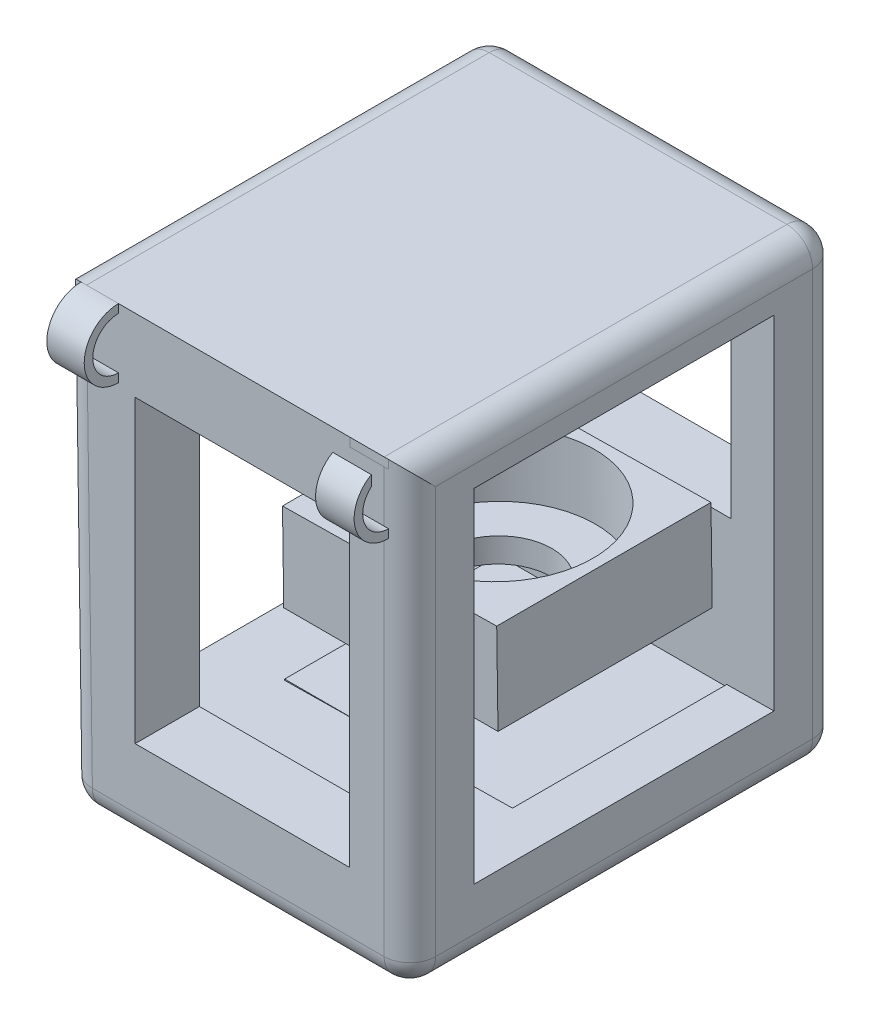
ISO-10303-21;
HEADER;
FILE_DESCRIPTION(('STEP AP214'),'2;1');
FILE_NAME('part.step','',(''),(''),'','','');
FILE_SCHEMA(('AUTOMOTIVE_DESIGN { 1 0 10303 214 1 1 1 1 }'));
ENDSEC;
DATA;
#1=APPLICATION_CONTEXT('core data for automotive mechanical design processes');
#2=APPLICATION_PROTOCOL_DEFINITION('international standard','automotive_design',2000,#1);
#3=PRODUCT_CONTEXT('',#1,'mechanical');
#4=PRODUCT('Part','Part','',(#3));
#5=PRODUCT_RELATED_PRODUCT_CATEGORY('part','',(#4));
#6=PRODUCT_DEFINITION_FORMATION('','',#4);
#7=PRODUCT_DEFINITION_CONTEXT('part definition',#1,'design');
#8=PRODUCT_DEFINITION('design','',#6,#7);
#9=PRODUCT_DEFINITION_SHAPE('','',#8);
#10=(LENGTH_UNIT() NAMED_UNIT(*) SI_UNIT(.MILLI.,.METRE.));
#11=(NAMED_UNIT(*) PLANE_ANGLE_UNIT() SI_UNIT($,.RADIAN.));
#12=(NAMED_UNIT(*) SI_UNIT($,.STERADIAN.) SOLID_ANGLE_UNIT());
#13=UNCERTAINTY_MEASURE_WITH_UNIT(LENGTH_MEASURE(1.E-05),#10,'distance_accuracy_value','');
#14=(GEOMETRIC_REPRESENTATION_CONTEXT(3) GLOBAL_UNCERTAINTY_ASSIGNED_CONTEXT((#13)) GLOBAL_UNIT_ASSIGNED_CONTEXT((#10,
#11,#12)) REPRESENTATION_CONTEXT('',''));
#15=CARTESIAN_POINT('',(0.,0.,0.));
#16=DIRECTION('',(0.,0.,1.));
#17=DIRECTION('',(1.,0.,0.));
#18=AXIS2_PLACEMENT_3D('',#15,#16,#17);
#19=CARTESIAN_POINT('',(-2.18830769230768,118.110000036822,127.));
#20=DIRECTION('',(0.,6.95149729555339E-05,0.999999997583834));
#21=DIRECTION('',(0.,-0.999999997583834,6.95149729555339E-05));
#22=AXIS2_PLACEMENT_3D('',#19,#20,#21);
#23=PLANE('',#22);
#24=DIRECTION('',(0.,0.999999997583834,-6.95149729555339E-05));
#25=VECTOR('',#24,1.);
#26=CARTESIAN_POINT('',(95.25,118.110000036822,127.));
#27=LINE('',#26,#25);
#28=CARTESIAN_POINT('',(95.25,115.570000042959,127.000176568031));
#29=VERTEX_POINT('',#28);
#30=CARTESIAN_POINT('',(95.25,118.110000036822,127.));
#31=VERTEX_POINT('',#30);
#32=EDGE_CURVE('E88',#29,#31,#27,.T.);
#33=ORIENTED_EDGE('',*,*,#32,.F.);
#34=DIRECTION('',(1.,0.,0.));
#35=VECTOR('',#34,1.);
#36=CARTESIAN_POINT('',(-2.18830769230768,115.570000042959,127.000176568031));
#37=LINE('',#36,#35);
#38=CARTESIAN_POINT('',(83.82,115.569999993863,127.000176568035));
#39=VERTEX_POINT('',#38);
#40=EDGE_CURVE('E105',#39,#29,#37,.T.);
#41=ORIENTED_EDGE('',*,*,#40,.F.);
#42=DIRECTION('',(0.,-0.999999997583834,6.95149729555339E-05));
#43=VECTOR('',#42,1.);
#44=CARTESIAN_POINT('',(83.82,118.110000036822,127.));
#45=LINE('',#44,#43);
#46=CARTESIAN_POINT('',(83.82,118.110000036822,127.));
#47=VERTEX_POINT('',#46);
#48=EDGE_CURVE('E109',#47,#39,#45,.T.);
#49=ORIENTED_EDGE('',*,*,#48,.F.);
#50=DIRECTION('',(1.,0.,0.));
#51=VECTOR('',#50,1.);
#52=CARTESIAN_POINT('',(-2.18830769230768,118.110000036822,127.));
#53=LINE('',#52,#51);
#54=EDGE_CURVE('E120',#47,#31,#53,.T.);
#55=ORIENTED_EDGE('',*,*,#54,.T.);
#56=EDGE_LOOP('',(#33,#41,#49,#55));
#57=FACE_BOUND('',#56,.T.);
#58=ADVANCED_FACE('F53',(#57),#23,.F.);
#59=CARTESIAN_POINT('',(-2.18830769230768,125.730000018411,126.999470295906));
#60=DIRECTION('',(1.,0.,0.));
#61=DIRECTION('',(0.,0.,-1.));
#62=AXIS2_PLACEMENT_3D('',#59,#60,#61);
#63=CYLINDRICAL_SURFACE('',#62,7.61999999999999);
#64=CARTESIAN_POINT('',(83.82,125.730000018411,126.999470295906));
#65=DIRECTION('',(-1.,0.,0.));
#66=DIRECTION('',(0.,0.,1.));
#67=AXIS2_PLACEMENT_3D('',#64,#65,#66);
#68=CIRCLE('',#67,7.61999999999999);
#69=CARTESIAN_POINT('',(83.82,131.408980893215,132.080176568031));
#70=VERTEX_POINT('',#69);
#71=EDGE_CURVE('E57',#70,#47,#68,.F.);
#72=ORIENTED_EDGE('',*,*,#71,.F.);
#73=DIRECTION('',(1.,0.,0.));
#74=VECTOR('',#73,1.);
#75=CARTESIAN_POINT('',(-2.18830769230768,131.408980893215,132.080176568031));
#76=LINE('',#75,#74);
#77=CARTESIAN_POINT('',(95.25,131.408980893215,132.080176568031));
#78=VERTEX_POINT('',#77);
#79=EDGE_CURVE('E69',#70,#78,#76,.T.);
#80=ORIENTED_EDGE('',*,*,#79,.T.);
#81=CARTESIAN_POINT('',(95.25,125.730000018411,126.999470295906));
#82=DIRECTION('',(1.,0.,0.));
#83=DIRECTION('',(0.,0.,-1.));
#84=AXIS2_PLACEMENT_3D('',#81,#82,#83);
#85=CIRCLE('',#84,7.61999999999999);
#86=EDGE_CURVE('E124',#31,#78,#85,.F.);
#87=ORIENTED_EDGE('',*,*,#86,.F.);
#88=ORIENTED_EDGE('',*,*,#54,.F.);
#89=EDGE_LOOP('',(#72,#80,#87,#88));
#90=FACE_BOUND('',#89,.T.);
#91=ADVANCED_FACE('F55',(#90),#63,.F.);
#92=CARTESIAN_POINT('',(-2.18830769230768,125.730000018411,126.999470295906));
#93=DIRECTION('',(1.,0.,0.));
#94=DIRECTION('',(0.,0.,-1.));
#95=AXIS2_PLACEMENT_3D('',#92,#93,#94);
#96=CYLINDRICAL_SURFACE('',#95,10.16);
#97=DIRECTION('',(1.,0.,0.));
#98=VECTOR('',#97,1.);
#99=CARTESIAN_POINT('',(-2.18830769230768,134.528410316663,132.080176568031));
#100=LINE('',#99,#98);
#101=CARTESIAN_POINT('',(83.82,134.528410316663,132.080176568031));
#102=VERTEX_POINT('',#101);
#103=CARTESIAN_POINT('',(95.25,134.528410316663,132.080176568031));
#104=VERTEX_POINT('',#103);
#105=EDGE_CURVE('E62',#102,#104,#100,.T.);
#106=ORIENTED_EDGE('',*,*,#105,.F.);
#107=CARTESIAN_POINT('',(83.82,125.730000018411,126.999470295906));
#108=DIRECTION('',(-1.,0.,0.));
#109=DIRECTION('',(0.,0.,1.));
#110=AXIS2_PLACEMENT_3D('',#107,#108,#109);
#111=CIRCLE('',#110,10.16);
#112=EDGE_CURVE('E101',#102,#39,#111,.F.);
#113=ORIENTED_EDGE('',*,*,#112,.T.);
#114=ORIENTED_EDGE('',*,*,#40,.T.);
#115=CARTESIAN_POINT('',(95.25,125.730000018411,126.999470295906));
#116=DIRECTION('',(1.,0.,0.));
#117=DIRECTION('',(0.,0.,-1.));
#118=AXIS2_PLACEMENT_3D('',#115,#116,#117);
#119=CIRCLE('',#118,10.16);
#120=EDGE_CURVE('E93',#29,#104,#119,.F.);
#121=ORIENTED_EDGE('',*,*,#120,.T.);
#122=EDGE_LOOP('',(#106,#113,#114,#121));
#123=FACE_BOUND('',#122,.T.);
#124=ADVANCED_FACE('F103',(#123),#96,.T.);
#125=CARTESIAN_POINT('',(83.82,115.569999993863,152.4));
#126=DIRECTION('',(-1.,0.,0.));
#127=DIRECTION('',(0.,0.,1.));
#128=AXIS2_PLACEMENT_3D('',#125,#126,#127);
#129=PLANE('',#128);
#130=DIRECTION('',(0.,1.,0.));
#131=VECTOR('',#130,1.);
#132=CARTESIAN_POINT('',(83.82,124.967999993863,132.080176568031));
#133=LINE('',#132,#131);
#134=EDGE_CURVE('E80',#70,#102,#133,.T.);
#135=ORIENTED_EDGE('',*,*,#134,.F.);
#136=ORIENTED_EDGE('',*,*,#71,.T.);
#137=ORIENTED_EDGE('',*,*,#48,.T.);
#138=ORIENTED_EDGE('',*,*,#112,.F.);
#139=EDGE_LOOP('',(#135,#136,#137,#138));
#140=FACE_BOUND('',#139,.T.);
#141=ADVANCED_FACE('F110',(#140),#129,.T.);
#142=CARTESIAN_POINT('',(95.25,135.889999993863,152.4));
#143=DIRECTION('',(1.,0.,0.));
#144=DIRECTION('',(0.,0.,-1.));
#145=AXIS2_PLACEMENT_3D('',#142,#143,#144);
#146=PLANE('',#145);
#147=DIRECTION('',(0.,-1.,0.));
#148=VECTOR('',#147,1.);
#149=CARTESIAN_POINT('',(95.25,135.889999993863,132.080176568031));
#150=LINE('',#149,#148);
#151=EDGE_CURVE('E13',#104,#78,#150,.T.);
#152=ORIENTED_EDGE('',*,*,#151,.F.);
#153=ORIENTED_EDGE('',*,*,#120,.F.);
#154=ORIENTED_EDGE('',*,*,#32,.T.);
#155=ORIENTED_EDGE('',*,*,#86,.T.);
#156=EDGE_LOOP('',(#152,#153,#154,#155));
#157=FACE_BOUND('',#156,.T.);
#158=ADVANCED_FACE('F125',(#157),#146,.T.);
#159=CARTESIAN_POINT('',(83.82,124.967999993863,132.080176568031));
#160=DIRECTION('',(0.,0.,1.));
#161=DIRECTION('',(1.,0.,0.));
#162=AXIS2_PLACEMENT_3D('',#159,#160,#161);
#163=PLANE('',#162);
#164=ORIENTED_EDGE('',*,*,#134,.T.);
#165=ORIENTED_EDGE('',*,*,#105,.T.);
#166=ORIENTED_EDGE('',*,*,#151,.T.);
#167=ORIENTED_EDGE('',*,*,#79,.F.);
#168=EDGE_LOOP('',(#164,#165,#166,#167));
#169=FACE_BOUND('',#168,.T.);
#170=ADVANCED_FACE('F137',(#169),#163,.F.);
#171=CLOSED_SHELL('',(#58,#91,#124,#141,#158,#170));
#172=MANIFOLD_SOLID_BREP('B2',#171);
#173=CARTESIAN_POINT('',(-2.18830769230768,125.730000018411,126.999470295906));
#174=DIRECTION('',(1.,0.,0.));
#175=DIRECTION('',(0.,0.,-1.));
#176=AXIS2_PLACEMENT_3D('',#173,#174,#175);
#177=CYLINDRICAL_SURFACE('',#176,10.16);
#178=DIRECTION('',(1.,0.,0.));
#179=VECTOR('',#178,1.);
#180=CARTESIAN_POINT('',(-2.18830769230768,135.889999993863,127.000176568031));
#181=LINE('',#180,#179);
#182=CARTESIAN_POINT('',(4.16169230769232,135.889999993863,127.000176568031));
#183=VERTEX_POINT('',#182);
#184=CARTESIAN_POINT('',(15.24,135.889999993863,127.000176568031));
#185=VERTEX_POINT('',#184);
#186=EDGE_CURVE('E242',#183,#185,#181,.T.);
#187=ORIENTED_EDGE('',*,*,#186,.F.);
#188=CARTESIAN_POINT('',(4.16169230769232,125.730000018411,126.999470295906));
#189=DIRECTION('',(-1.,0.,0.));
#190=DIRECTION('',(0.,0.,1.));
#191=AXIS2_PLACEMENT_3D('',#188,#189,#190);
#192=CIRCLE('',#191,10.16);
#193=CARTESIAN_POINT('',(4.16169230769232,115.570000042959,127.000176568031));
#194=VERTEX_POINT('',#193);
#195=EDGE_CURVE('E203',#183,#194,#192,.F.);
#196=ORIENTED_EDGE('',*,*,#195,.T.);
#197=DIRECTION('',(1.,0.,0.));
#198=VECTOR('',#197,1.);
#199=CARTESIAN_POINT('',(-2.18830769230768,115.570000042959,127.000176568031));
#200=LINE('',#199,#198);
#201=CARTESIAN_POINT('',(15.24,115.570000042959,127.000176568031));
#202=VERTEX_POINT('',#201);
#203=EDGE_CURVE('E190',#194,#202,#200,.T.);
#204=ORIENTED_EDGE('',*,*,#203,.T.);
#205=CARTESIAN_POINT('',(15.24,125.730000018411,126.999470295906));
#206=DIRECTION('',(1.,0.,0.));
#207=DIRECTION('',(0.,0.,-1.));
#208=AXIS2_PLACEMENT_3D('',#205,#206,#207);
#209=CIRCLE('',#208,10.16);
#210=EDGE_CURVE('E245',#202,#185,#209,.F.);
#211=ORIENTED_EDGE('',*,*,#210,.T.);
#212=EDGE_LOOP('',(#187,#196,#204,#211));
#213=FACE_BOUND('',#212,.T.);
#214=ADVANCED_FACE('F187',(#213),#177,.T.);
#215=CARTESIAN_POINT('',(-2.18830769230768,135.889999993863,127.000176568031));
#216=DIRECTION('',(0.,-6.95149729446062E-05,0.999999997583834));
#217=DIRECTION('',(0.,-0.999999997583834,-6.95149729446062E-05));
#218=AXIS2_PLACEMENT_3D('',#215,#216,#217);
#219=PLANE('',#218);
#220=DIRECTION('',(0.,-0.999999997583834,-6.95149729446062E-05));
#221=VECTOR('',#220,1.);
#222=CARTESIAN_POINT('',(4.16169230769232,135.889999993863,127.000176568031));
#223=LINE('',#222,#221);
#224=CARTESIAN_POINT('',(4.16169230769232,133.35,127.));
#225=VERTEX_POINT('',#224);
#226=EDGE_CURVE('E223',#183,#225,#223,.T.);
#227=ORIENTED_EDGE('',*,*,#226,.F.);
#228=ORIENTED_EDGE('',*,*,#186,.T.);
#229=DIRECTION('',(0.,0.999999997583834,6.95149729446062E-05));
#230=VECTOR('',#229,1.);
#231=CARTESIAN_POINT('',(15.24,135.889999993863,127.000176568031));
#232=LINE('',#231,#230);
#233=CARTESIAN_POINT('',(15.24,133.35,127.));
#234=VERTEX_POINT('',#233);
#235=EDGE_CURVE('E229',#234,#185,#232,.T.);
#236=ORIENTED_EDGE('',*,*,#235,.F.);
#237=DIRECTION('',(1.,0.,0.));
#238=VECTOR('',#237,1.);
#239=CARTESIAN_POINT('',(-2.18830769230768,133.35,127.));
#240=LINE('',#239,#238);
#241=EDGE_CURVE('E236',#225,#234,#240,.T.);
#242=ORIENTED_EDGE('',*,*,#241,.F.);
#243=EDGE_LOOP('',(#227,#228,#236,#242));
#244=FACE_BOUND('',#243,.T.);
#245=ADVANCED_FACE('F241',(#244),#219,.F.);
#246=CARTESIAN_POINT('',(-2.18830769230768,125.730000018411,126.999470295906));
#247=DIRECTION('',(1.,0.,0.));
#248=DIRECTION('',(0.,0.,-1.));
#249=AXIS2_PLACEMENT_3D('',#246,#247,#248);
#250=CYLINDRICAL_SURFACE('',#249,7.61999999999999);
#251=CARTESIAN_POINT('',(4.16169230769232,125.730000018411,126.999470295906));
#252=DIRECTION('',(-1.,0.,0.));
#253=DIRECTION('',(0.,0.,1.));
#254=AXIS2_PLACEMENT_3D('',#251,#252,#253);
#255=CIRCLE('',#254,7.61999999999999);
#256=CARTESIAN_POINT('',(4.16169230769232,118.110000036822,127.));
#257=VERTEX_POINT('',#256);
#258=EDGE_CURVE('E196',#225,#257,#255,.F.);
#259=ORIENTED_EDGE('',*,*,#258,.F.);
#260=ORIENTED_EDGE('',*,*,#241,.T.);
#261=CARTESIAN_POINT('',(15.24,125.730000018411,126.999470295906));
#262=DIRECTION('',(1.,0.,0.));
#263=DIRECTION('',(0.,0.,-1.));
#264=AXIS2_PLACEMENT_3D('',#261,#262,#263);
#265=CIRCLE('',#264,7.61999999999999);
#266=CARTESIAN_POINT('',(15.24,118.110000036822,127.));
#267=VERTEX_POINT('',#266);
#268=EDGE_CURVE('E248',#267,#234,#265,.F.);
#269=ORIENTED_EDGE('',*,*,#268,.F.);
#270=DIRECTION('',(1.,0.,0.));
#271=VECTOR('',#270,1.);
#272=CARTESIAN_POINT('',(-2.18830769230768,118.110000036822,127.));
#273=LINE('',#272,#271);
#274=EDGE_CURVE('E238',#257,#267,#273,.T.);
#275=ORIENTED_EDGE('',*,*,#274,.F.);
#276=EDGE_LOOP('',(#259,#260,#269,#275));
#277=FACE_BOUND('',#276,.T.);
#278=ADVANCED_FACE('F234',(#277),#250,.F.);
#279=CARTESIAN_POINT('',(-2.18830769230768,118.110000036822,127.));
#280=DIRECTION('',(0.,6.95149729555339E-05,0.999999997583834));
#281=DIRECTION('',(0.,-0.999999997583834,6.95149729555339E-05));
#282=AXIS2_PLACEMENT_3D('',#279,#280,#281);
#283=PLANE('',#282);
#284=DIRECTION('',(0.,-0.999999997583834,6.95149729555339E-05));
#285=VECTOR('',#284,1.);
#286=CARTESIAN_POINT('',(4.16169230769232,118.110000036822,127.));
#287=LINE('',#286,#285);
#288=EDGE_CURVE('E51',#257,#194,#287,.T.);
#289=ORIENTED_EDGE('',*,*,#288,.F.);
#290=ORIENTED_EDGE('',*,*,#274,.T.);
#291=DIRECTION('',(0.,0.999999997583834,-6.95149729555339E-05));
#292=VECTOR('',#291,1.);
#293=CARTESIAN_POINT('',(15.24,118.110000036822,127.));
#294=LINE('',#293,#292);
#295=EDGE_CURVE('E244',#202,#267,#294,.T.);
#296=ORIENTED_EDGE('',*,*,#295,.F.);
#297=ORIENTED_EDGE('',*,*,#203,.F.);
#298=EDGE_LOOP('',(#289,#290,#296,#297));
#299=FACE_BOUND('',#298,.T.);
#300=ADVANCED_FACE('F260',(#299),#283,.F.);
#301=CARTESIAN_POINT('',(15.24,115.569999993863,152.4));
#302=DIRECTION('',(1.,0.,0.));
#303=DIRECTION('',(0.,0.,-1.));
#304=AXIS2_PLACEMENT_3D('',#301,#302,#303);
#305=PLANE('',#304);
#306=ORIENTED_EDGE('',*,*,#295,.T.);
#307=ORIENTED_EDGE('',*,*,#268,.T.);
#308=ORIENTED_EDGE('',*,*,#235,.T.);
#309=ORIENTED_EDGE('',*,*,#210,.F.);
#310=EDGE_LOOP('',(#306,#307,#308,#309));
#311=FACE_BOUND('',#310,.T.);
#312=ADVANCED_FACE('F256',(#311),#305,.T.);
#313=CARTESIAN_POINT('',(4.16169230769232,115.570000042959,152.4));
#314=DIRECTION('',(-1.,0.,0.));
#315=DIRECTION('',(0.,0.,1.));
#316=AXIS2_PLACEMENT_3D('',#313,#314,#315);
#317=PLANE('',#316);
#318=ORIENTED_EDGE('',*,*,#226,.T.);
#319=ORIENTED_EDGE('',*,*,#258,.T.);
#320=ORIENTED_EDGE('',*,*,#288,.T.);
#321=ORIENTED_EDGE('',*,*,#195,.F.);
#322=EDGE_LOOP('',(#318,#319,#320,#321));
#323=FACE_BOUND('',#322,.T.);
#324=ADVANCED_FACE('F224',(#323),#317,.T.);
#325=CLOSED_SHELL('',(#214,#245,#278,#300,#312,#324));
#326=MANIFOLD_SOLID_BREP('B7',#325);
#327=CARTESIAN_POINT('',(83.82,115.569999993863,152.4));
#328=DIRECTION('',(-1.,0.,0.));
#329=DIRECTION('',(0.,0.,1.));
#330=AXIS2_PLACEMENT_3D('',#327,#328,#329);
#331=PLANE('',#330);
#332=DIRECTION('',(0.,1.,0.));
#333=VECTOR('',#332,1.);
#334=CARTESIAN_POINT('',(83.82,124.967999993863,127.000176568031));
#335=LINE('',#334,#333);
#336=CARTESIAN_POINT('',(83.82,133.34999998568,127.000176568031));
#337=VERTEX_POINT('',#336);
#338=CARTESIAN_POINT('',(83.82,135.889999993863,127.000176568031));
#339=VERTEX_POINT('',#338);
#340=EDGE_CURVE('E375',#337,#339,#335,.T.);
#341=ORIENTED_EDGE('',*,*,#340,.T.);
#342=DIRECTION('',(0.,-0.999999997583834,-6.95149729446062E-05));
#343=VECTOR('',#342,1.);
#344=CARTESIAN_POINT('',(83.82,135.889999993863,127.000176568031));
#345=LINE('',#344,#343);
#346=CARTESIAN_POINT('',(83.82,133.35,127.));
#347=VERTEX_POINT('',#346);
#348=EDGE_CURVE('E342',#339,#347,#345,.T.);
#349=ORIENTED_EDGE('',*,*,#348,.T.);
#350=CARTESIAN_POINT('',(83.82,125.730000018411,126.999470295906));
#351=DIRECTION('',(-1.,0.,0.));
#352=DIRECTION('',(0.,0.,1.));
#353=AXIS2_PLACEMENT_3D('',#350,#351,#352);
#354=CIRCLE('',#353,7.61999999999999);
#355=EDGE_CURVE('E372',#347,#337,#354,.F.);
#356=ORIENTED_EDGE('',*,*,#355,.T.);
#357=EDGE_LOOP('',(#341,#349,#356));
#358=FACE_BOUND('',#357,.T.);
#359=ADVANCED_FACE('F320',(#358),#331,.T.);
#360=CARTESIAN_POINT('',(95.25,135.889999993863,152.4));
#361=DIRECTION('',(1.,0.,0.));
#362=DIRECTION('',(0.,0.,-1.));
#363=AXIS2_PLACEMENT_3D('',#360,#361,#362);
#364=PLANE('',#363);
#365=DIRECTION('',(0.,1.,0.));
#366=VECTOR('',#365,1.);
#367=CARTESIAN_POINT('',(95.25,135.889999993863,127.000176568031));
#368=LINE('',#367,#366);
#369=CARTESIAN_POINT('',(95.25,133.34999998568,127.000176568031));
#370=VERTEX_POINT('',#369);
#371=CARTESIAN_POINT('',(95.25,135.889999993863,127.000176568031));
#372=VERTEX_POINT('',#371);
#373=EDGE_CURVE('E185',#370,#372,#368,.T.);
#374=ORIENTED_EDGE('',*,*,#373,.F.);
#375=CARTESIAN_POINT('',(95.25,125.730000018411,126.999470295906));
#376=DIRECTION('',(1.,0.,0.));
#377=DIRECTION('',(0.,0.,-1.));
#378=AXIS2_PLACEMENT_3D('',#375,#376,#377);
#379=CIRCLE('',#378,7.61999999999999);
#380=CARTESIAN_POINT('',(95.25,133.35,127.));
#381=VERTEX_POINT('',#380);
#382=EDGE_CURVE('E361',#370,#381,#379,.F.);
#383=ORIENTED_EDGE('',*,*,#382,.T.);
#384=DIRECTION('',(0.,0.999999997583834,6.95149729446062E-05));
#385=VECTOR('',#384,1.);
#386=CARTESIAN_POINT('',(95.25,135.889999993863,127.000176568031));
#387=LINE('',#386,#385);
#388=EDGE_CURVE('E359',#381,#372,#387,.T.);
#389=ORIENTED_EDGE('',*,*,#388,.T.);
#390=EDGE_LOOP('',(#374,#383,#389));
#391=FACE_BOUND('',#390,.T.);
#392=ADVANCED_FACE('F360',(#391),#364,.T.);
#393=CARTESIAN_POINT('',(-2.18830769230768,135.889999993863,127.000176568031));
#394=DIRECTION('',(0.,-6.95149729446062E-05,0.999999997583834));
#395=DIRECTION('',(0.,-0.999999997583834,-6.95149729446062E-05));
#396=AXIS2_PLACEMENT_3D('',#393,#394,#395);
#397=PLANE('',#396);
#398=ORIENTED_EDGE('',*,*,#388,.F.);
#399=DIRECTION('',(1.,0.,0.));
#400=VECTOR('',#399,1.);
#401=CARTESIAN_POINT('',(-2.18830769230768,133.35,127.));
#402=LINE('',#401,#400);
#403=EDGE_CURVE('E365',#347,#381,#402,.T.);
#404=ORIENTED_EDGE('',*,*,#403,.F.);
#405=ORIENTED_EDGE('',*,*,#348,.F.);
#406=DIRECTION('',(1.,0.,0.));
#407=VECTOR('',#406,1.);
#408=CARTESIAN_POINT('',(-2.18830769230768,135.889999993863,127.000176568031));
#409=LINE('',#408,#407);
#410=EDGE_CURVE('E328',#339,#372,#409,.T.);
#411=ORIENTED_EDGE('',*,*,#410,.T.);
#412=EDGE_LOOP('',(#398,#404,#405,#411));
#413=FACE_BOUND('',#412,.T.);
#414=ADVANCED_FACE('F367',(#413),#397,.F.);
#415=CARTESIAN_POINT('',(-2.18830769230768,125.730000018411,126.999470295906));
#416=DIRECTION('',(1.,0.,0.));
#417=DIRECTION('',(0.,0.,-1.));
#418=AXIS2_PLACEMENT_3D('',#415,#416,#417);
#419=CYLINDRICAL_SURFACE('',#418,7.61999999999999);
#420=ORIENTED_EDGE('',*,*,#382,.F.);
#421=DIRECTION('',(1.,0.,0.));
#422=VECTOR('',#421,1.);
#423=CARTESIAN_POINT('',(-2.18830769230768,133.34999998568,127.000176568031));
#424=LINE('',#423,#422);
#425=EDGE_CURVE('E334',#370,#337,#424,.F.);
#426=ORIENTED_EDGE('',*,*,#425,.T.);
#427=ORIENTED_EDGE('',*,*,#355,.F.);
#428=ORIENTED_EDGE('',*,*,#403,.T.);
#429=EDGE_LOOP('',(#420,#426,#427,#428));
#430=FACE_BOUND('',#429,.T.);
#431=ADVANCED_FACE('F322',(#430),#419,.F.);
#432=CARTESIAN_POINT('',(83.82,124.967999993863,127.000176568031));
#433=DIRECTION('',(0.,0.,-1.));
#434=DIRECTION('',(-1.,0.,0.));
#435=AXIS2_PLACEMENT_3D('',#432,#433,#434);
#436=PLANE('',#435);
#437=ORIENTED_EDGE('',*,*,#373,.T.);
#438=ORIENTED_EDGE('',*,*,#410,.F.);
#439=ORIENTED_EDGE('',*,*,#340,.F.);
#440=ORIENTED_EDGE('',*,*,#425,.F.);
#441=EDGE_LOOP('',(#437,#438,#439,#440));
#442=FACE_BOUND('',#441,.T.);
#443=ADVANCED_FACE('F354',(#442),#436,.F.);
#444=CLOSED_SHELL('',(#359,#392,#414,#431,#443));
#445=MANIFOLD_SOLID_BREP('B45',#444);
#446=CARTESIAN_POINT('',(83.5378500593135,20.2514816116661,82.55));
#447=DIRECTION('',(0.,0.,1.));
#448=DIRECTION('',(1.,0.,0.));
#449=AXIS2_PLACEMENT_3D('',#446,#447,#448);
#450=PLANE('',#449);
#451=DIRECTION('',(-1.,0.,0.));
#452=VECTOR('',#451,1.);
#453=CARTESIAN_POINT('',(17.7053336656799,37.8483949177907,82.55));
#454=LINE('',#453,#452);
#455=CARTESIAN_POINT('',(83.2851764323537,37.8483949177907,82.55));
#456=VERTEX_POINT('',#455);
#457=CARTESIAN_POINT('',(19.7786305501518,37.8483949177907,82.55));
#458=VERTEX_POINT('',#457);
#459=EDGE_CURVE('E666',#456,#458,#454,.T.);
#460=ORIENTED_EDGE('',*,*,#459,.F.);
#461=DIRECTION('',(-0.0143574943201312,0.999896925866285,0.));
#462=VECTOR('',#461,1.);
#463=CARTESIAN_POINT('',(83.5378500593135,20.2514816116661,82.55));
#464=LINE('',#463,#462);
#465=CARTESIAN_POINT('',(82.8996594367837,64.6968999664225,82.55));
#466=VERTEX_POINT('',#465);
#467=EDGE_CURVE('E698',#456,#466,#464,.T.);
#468=ORIENTED_EDGE('',*,*,#467,.T.);
#469=DIRECTION('',(-0.999896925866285,-0.0143574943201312,0.));
#470=VECTOR('',#469,1.);
#471=CARTESIAN_POINT('',(82.8996594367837,64.6968999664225,82.55));
#472=LINE('',#471,#470);
#473=CARTESIAN_POINT('',(19.4062046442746,63.7851990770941,82.55));
#474=VERTEX_POINT('',#473);
#475=EDGE_CURVE('E729',#466,#474,#472,.T.);
#476=ORIENTED_EDGE('',*,*,#475,.T.);
#477=DIRECTION('',(-0.0143574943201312,0.999896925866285,0.));
#478=VECTOR('',#477,1.);
#479=CARTESIAN_POINT('',(20.0443952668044,19.3397807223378,82.55));
#480=LINE('',#479,#478);
#481=EDGE_CURVE('E716',#458,#474,#480,.T.);
#482=ORIENTED_EDGE('',*,*,#481,.F.);
#483=EDGE_LOOP('',(#460,#468,#476,#482));
#484=FACE_BOUND('',#483,.T.);
#485=ADVANCED_FACE('F418',(#484),#450,.T.);
#486=CARTESIAN_POINT('',(20.3179055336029,0.291744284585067,0.));
#487=DIRECTION('',(0.999896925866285,0.0143574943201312,0.));
#488=DIRECTION('',(-0.0143574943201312,0.999896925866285,0.));
#489=AXIS2_PLACEMENT_3D('',#486,#487,#488);
#490=PLANE('',#489);
#491=DIRECTION('',(0.0143574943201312,-0.999896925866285,0.));
#492=VECTOR('',#491,1.);
#493=CARTESIAN_POINT('',(20.0443952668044,19.3397807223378,19.05));
#494=LINE('',#493,#492);
#495=CARTESIAN_POINT('',(19.4102998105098,63.5,19.05));
#496=VERTEX_POINT('',#495);
#497=CARTESIAN_POINT('',(19.7786305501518,37.8483949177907,19.05));
#498=VERTEX_POINT('',#497);
#499=EDGE_CURVE('E712',#496,#498,#494,.T.);
#500=ORIENTED_EDGE('',*,*,#499,.T.);
#501=DIRECTION('',(0.,0.,1.));
#502=VECTOR('',#501,1.);
#503=CARTESIAN_POINT('',(19.7786305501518,37.8483949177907,0.));
#504=LINE('',#503,#502);
#505=EDGE_CURVE('E675',#498,#458,#504,.T.);
#506=ORIENTED_EDGE('',*,*,#505,.T.);
#507=ORIENTED_EDGE('',*,*,#481,.T.);
#508=DIRECTION('',(0.,0.,-1.));
#509=VECTOR('',#508,1.);
#510=CARTESIAN_POINT('',(19.4062046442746,63.7851990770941,19.05));
#511=LINE('',#510,#509);
#512=CARTESIAN_POINT('',(19.4062046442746,63.7851990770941,19.05));
#513=VERTEX_POINT('',#512);
#514=EDGE_CURVE('E721',#474,#513,#511,.T.);
#515=ORIENTED_EDGE('',*,*,#514,.T.);
#516=EDGE_CURVE('E707',#513,#496,#494,.T.);
#517=ORIENTED_EDGE('',*,*,#516,.T.);
#518=EDGE_LOOP('',(#500,#506,#507,#515,#517));
#519=FACE_BOUND('',#518,.T.);
#520=ADVANCED_FACE('F1138',(#519),#490,.F.);
#521=CARTESIAN_POINT('',(-2.18830769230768,152.4,127.));
#522=DIRECTION('',(0.999896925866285,0.0143574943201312,0.));
#523=DIRECTION('',(-0.0143574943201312,0.999896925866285,0.));
#524=AXIS2_PLACEMENT_3D('',#521,#522,#523);
#525=PLANE('',#524);
#526=DIRECTION('',(0.0143574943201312,-0.999896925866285,0.));
#527=VECTOR('',#526,1.);
#528=CARTESIAN_POINT('',(-2.18830769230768,152.4,7.62));
#529=LINE('',#528,#527);
#530=CARTESIAN_POINT('',(-1.84025471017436,128.160595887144,7.62));
#531=VERTEX_POINT('',#530);
#532=CARTESIAN_POINT('',(-0.107844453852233,7.5105958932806,7.62));
#533=VERTEX_POINT('',#532);
#534=EDGE_CURVE('E888',#531,#533,#529,.T.);
#535=ORIENTED_EDGE('',*,*,#534,.T.);
#536=DIRECTION('',(0.,0.,-1.));
#537=VECTOR('',#536,1.);
#538=CARTESIAN_POINT('',(-0.107844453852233,7.51059589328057,127.));
#539=LINE('',#538,#537);
#540=CARTESIAN_POINT('',(-0.107844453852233,7.5105958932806,119.38));
#541=VERTEX_POINT('',#540);
#542=EDGE_CURVE('E892',#533,#541,#539,.F.);
#543=ORIENTED_EDGE('',*,*,#542,.T.);
#544=DIRECTION('',(0.0143574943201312,-0.999896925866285,0.));
#545=VECTOR('',#544,1.);
#546=CARTESIAN_POINT('',(-1.9512410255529,135.889999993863,119.38));
#547=LINE('',#546,#545);
#548=CARTESIAN_POINT('',(-1.84025471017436,128.160595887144,119.38));
#549=VERTEX_POINT('',#548);
#550=EDGE_CURVE('E885',#541,#549,#547,.F.);
#551=ORIENTED_EDGE('',*,*,#550,.T.);
#552=DIRECTION('',(0.,0.,-1.));
#553=VECTOR('',#552,1.);
#554=CARTESIAN_POINT('',(-1.84025471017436,128.160595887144,127.));
#555=LINE('',#554,#553);
#556=EDGE_CURVE('E882',#549,#531,#555,.T.);
#557=ORIENTED_EDGE('',*,*,#556,.T.);
#558=EDGE_LOOP('',(#535,#543,#551,#557));
#559=FACE_BOUND('',#558,.T.);
#560=DIRECTION('',(0.,0.,1.));
#561=VECTOR('',#560,1.);
#562=CARTESIAN_POINT('',(-0.2735102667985,19.0480364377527,19.05));
#563=LINE('',#562,#561);
#564=CARTESIAN_POINT('',(-0.273510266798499,19.0480364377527,19.05));
#565=VERTEX_POINT('',#564);
#566=CARTESIAN_POINT('',(-0.2735102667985,19.0480364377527,107.95));
#567=VERTEX_POINT('',#566);
#568=EDGE_CURVE('E799',#565,#567,#563,.T.);
#569=ORIENTED_EDGE('',*,*,#568,.F.);
#570=DIRECTION('',(0.0143574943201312,-0.999896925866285,0.));
#571=VECTOR('',#570,1.);
#572=CARTESIAN_POINT('',(-1.73223168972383,120.637564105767,19.05));
#573=LINE('',#572,#571);
#574=CARTESIAN_POINT('',(-1.73223168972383,120.637564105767,19.05));
#575=VERTEX_POINT('',#574);
#576=EDGE_CURVE('E786',#575,#565,#573,.T.);
#577=ORIENTED_EDGE('',*,*,#576,.F.);
#578=DIRECTION('',(0.,0.,-1.));
#579=VECTOR('',#578,1.);
#580=CARTESIAN_POINT('',(-1.73223168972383,120.637564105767,19.05));
#581=LINE('',#580,#579);
#582=CARTESIAN_POINT('',(-1.73223168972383,120.637564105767,107.95));
#583=VERTEX_POINT('',#582);
#584=EDGE_CURVE('E807',#583,#575,#581,.T.);
#585=ORIENTED_EDGE('',*,*,#584,.F.);
#586=DIRECTION('',(-0.0143574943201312,0.999896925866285,0.));
#587=VECTOR('',#586,1.);
#588=CARTESIAN_POINT('',(-1.73223168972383,120.637564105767,107.95));
#589=LINE('',#588,#587);
#590=EDGE_CURVE('E803',#567,#583,#589,.T.);
#591=ORIENTED_EDGE('',*,*,#590,.F.);
#592=EDGE_LOOP('',(#569,#577,#585,#591));
#593=FACE_BOUND('',#592,.T.);
#594=ADVANCED_FACE('F1083',(#559,#593),#525,.F.);
#595=CARTESIAN_POINT('',(0.,0.,127.));
#596=DIRECTION('',(0.,1.,0.));
#597=DIRECTION('',(0.,0.,1.));
#598=AXIS2_PLACEMENT_3D('',#595,#596,#597);
#599=PLANE('',#598);
#600=DIRECTION('',(0.,0.,-1.));
#601=VECTOR('',#600,1.);
#602=CARTESIAN_POINT('',(93.98,0.,127.));
#603=LINE('',#602,#601);
#604=CARTESIAN_POINT('',(93.98,0.,7.62));
#605=VERTEX_POINT('',#604);
#606=CARTESIAN_POINT('',(93.98,0.,119.38));
#607=VERTEX_POINT('',#606);
#608=EDGE_CURVE('E934',#605,#607,#603,.F.);
#609=ORIENTED_EDGE('',*,*,#608,.T.);
#610=DIRECTION('',(1.,0.,0.));
#611=VECTOR('',#610,1.);
#612=CARTESIAN_POINT('',(0.,0.,119.38));
#613=LINE('',#612,#611);
#614=CARTESIAN_POINT('',(7.51137012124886,0.,119.38));
#615=VERTEX_POINT('',#614);
#616=EDGE_CURVE('E943',#607,#615,#613,.F.);
#617=ORIENTED_EDGE('',*,*,#616,.T.);
#618=DIRECTION('',(0.,0.,-1.));
#619=VECTOR('',#618,1.);
#620=CARTESIAN_POINT('',(7.51137012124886,0.,127.));
#621=LINE('',#620,#619);
#622=CARTESIAN_POINT('',(7.51137012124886,0.,7.62));
#623=VERTEX_POINT('',#622);
#624=EDGE_CURVE('E940',#615,#623,#621,.T.);
#625=ORIENTED_EDGE('',*,*,#624,.T.);
#626=DIRECTION('',(1.,0.,0.));
#627=VECTOR('',#626,1.);
#628=CARTESIAN_POINT('',(0.,0.,7.62));
#629=LINE('',#628,#627);
#630=EDGE_CURVE('E937',#623,#605,#629,.T.);
#631=ORIENTED_EDGE('',*,*,#630,.T.);
#632=EDGE_LOOP('',(#609,#617,#625,#631));
#633=FACE_BOUND('',#632,.T.);
#634=ADVANCED_FACE('F1041',(#633),#599,.F.);
#635=CARTESIAN_POINT('',(101.6,0.,127.));
#636=DIRECTION('',(-1.,0.,0.));
#637=DIRECTION('',(0.,0.,1.));
#638=AXIS2_PLACEMENT_3D('',#635,#636,#637);
#639=PLANE('',#638);
#640=DIRECTION('',(0.,1.,0.));
#641=VECTOR('',#640,1.);
#642=CARTESIAN_POINT('',(101.6,0.,119.38));
#643=LINE('',#642,#641);
#644=CARTESIAN_POINT('',(101.6,128.269999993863,119.38));
#645=VERTEX_POINT('',#644);
#646=CARTESIAN_POINT('',(101.6,7.62,119.38));
#647=VERTEX_POINT('',#646);
#648=EDGE_CURVE('E911',#645,#647,#643,.F.);
#649=ORIENTED_EDGE('',*,*,#648,.T.);
#650=DIRECTION('',(0.,0.,-1.));
#651=VECTOR('',#650,1.);
#652=CARTESIAN_POINT('',(101.6,7.62,127.));
#653=LINE('',#652,#651);
#654=CARTESIAN_POINT('',(101.6,7.62,7.62));
#655=VERTEX_POINT('',#654);
#656=EDGE_CURVE('E918',#647,#655,#653,.T.);
#657=ORIENTED_EDGE('',*,*,#656,.T.);
#658=DIRECTION('',(0.,1.,0.));
#659=VECTOR('',#658,1.);
#660=CARTESIAN_POINT('',(101.6,0.,7.62));
#661=LINE('',#660,#659);
#662=CARTESIAN_POINT('',(101.6,128.269999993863,7.62));
#663=VERTEX_POINT('',#662);
#664=EDGE_CURVE('E914',#655,#663,#661,.T.);
#665=ORIENTED_EDGE('',*,*,#664,.T.);
#666=DIRECTION('',(0.,0.,1.));
#667=VECTOR('',#666,1.);
#668=CARTESIAN_POINT('',(101.6,128.269999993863,127.));
#669=LINE('',#668,#667);
#670=EDGE_CURVE('E908',#663,#645,#669,.T.);
#671=ORIENTED_EDGE('',*,*,#670,.T.);
#672=EDGE_LOOP('',(#649,#657,#665,#671));
#673=FACE_BOUND('',#672,.T.);
#674=DIRECTION('',(0.,0.,-1.));
#675=VECTOR('',#674,1.);
#676=CARTESIAN_POINT('',(101.6,122.121308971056,127.));
#677=LINE('',#676,#675);
#678=CARTESIAN_POINT('',(101.6,122.121308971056,107.95));
#679=VERTEX_POINT('',#678);
#680=CARTESIAN_POINT('',(101.6,122.121308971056,19.05));
#681=VERTEX_POINT('',#680);
#682=EDGE_CURVE('E832',#679,#681,#677,.T.);
#683=ORIENTED_EDGE('',*,*,#682,.T.);
#684=DIRECTION('',(0.,-1.,0.));
#685=VECTOR('',#684,1.);
#686=CARTESIAN_POINT('',(101.6,0.,19.05));
#687=LINE('',#686,#685);
#688=CARTESIAN_POINT('',(101.6,20.5108355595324,19.05));
#689=VERTEX_POINT('',#688);
#690=EDGE_CURVE('E836',#681,#689,#687,.T.);
#691=ORIENTED_EDGE('',*,*,#690,.T.);
#692=DIRECTION('',(0.,0.,1.));
#693=VECTOR('',#692,1.);
#694=CARTESIAN_POINT('',(101.6,20.5108355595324,127.));
#695=LINE('',#694,#693);
#696=CARTESIAN_POINT('',(101.6,20.5108355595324,107.95));
#697=VERTEX_POINT('',#696);
#698=EDGE_CURVE('E815',#689,#697,#695,.T.);
#699=ORIENTED_EDGE('',*,*,#698,.T.);
#700=DIRECTION('',(0.,1.,0.));
#701=VECTOR('',#700,1.);
#702=CARTESIAN_POINT('',(101.6,0.,107.95));
#703=LINE('',#702,#701);
#704=EDGE_CURVE('E828',#697,#679,#703,.T.);
#705=ORIENTED_EDGE('',*,*,#704,.T.);
#706=EDGE_LOOP('',(#683,#691,#699,#705));
#707=FACE_BOUND('',#706,.T.);
#708=ADVANCED_FACE('F1049',(#673,#707),#639,.F.);
#709=CARTESIAN_POINT('',(0.,0.,127.));
#710=DIRECTION('',(0.,0.,1.));
#711=DIRECTION('',(1.,0.,0.));
#712=AXIS2_PLACEMENT_3D('',#709,#710,#711);
#713=PLANE('',#712);
#714=DIRECTION('',(1.,0.,0.));
#715=VECTOR('',#714,1.);
#716=CARTESIAN_POINT('',(101.6,7.62,127.));
#717=LINE('',#716,#715);
#718=CARTESIAN_POINT('',(7.51137012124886,7.62,127.));
#719=VERTEX_POINT('',#718);
#720=CARTESIAN_POINT('',(93.98,7.62,127.));
#721=VERTEX_POINT('',#720);
#722=EDGE_CURVE('E928',#719,#721,#717,.T.);
#723=ORIENTED_EDGE('',*,*,#722,.T.);
#724=DIRECTION('',(0.,1.,0.));
#725=VECTOR('',#724,1.);
#726=CARTESIAN_POINT('',(93.98,135.889999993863,127.));
#727=LINE('',#726,#725);
#728=CARTESIAN_POINT('',(93.98,135.889999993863,127.));
#729=VERTEX_POINT('',#728);
#730=EDGE_CURVE('E931',#721,#729,#727,.T.);
#731=ORIENTED_EDGE('',*,*,#730,.T.);
#732=DIRECTION('',(1.,0.,0.));
#733=VECTOR('',#732,1.);
#734=CARTESIAN_POINT('',(101.6,135.889999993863,127.));
#735=LINE('',#734,#733);
#736=CARTESIAN_POINT('',(5.77895986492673,135.889999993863,127.));
#737=VERTEX_POINT('',#736);
#738=EDGE_CURVE('E728',#737,#729,#735,.T.);
#739=ORIENTED_EDGE('',*,*,#738,.F.);
#740=CARTESIAN_POINT('',(5.77895986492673,128.269999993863,127.));
#741=DIRECTION('',(0.,0.,1.));
#742=DIRECTION('',(1.,0.,0.));
#743=AXIS2_PLACEMENT_3D('',#740,#741,#742);
#744=CIRCLE('',#743,7.62);
#745=CARTESIAN_POINT('',(5.66955575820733,135.889214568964,127.));
#746=VERTEX_POINT('',#745);
#747=EDGE_CURVE('E921',#737,#746,#744,.T.);
#748=ORIENTED_EDGE('',*,*,#747,.T.);
#749=DIRECTION('',(0.0143574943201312,-0.999896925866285,0.));
#750=VECTOR('',#749,1.);
#751=CARTESIAN_POINT('',(7.61921457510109,0.1094041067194,127.));
#752=LINE('',#751,#750);
#753=EDGE_CURVE('E924',#746,#719,#752,.T.);
#754=ORIENTED_EDGE('',*,*,#753,.T.);
#755=EDGE_LOOP('',(#723,#731,#739,#748,#754));
#756=FACE_BOUND('',#755,.T.);
#757=DIRECTION('',(-1.,0.,0.));
#758=VECTOR('',#757,1.);
#759=CARTESIAN_POINT('',(20.1897408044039,114.3,127.));
#760=LINE('',#759,#758);
#761=CARTESIAN_POINT('',(83.6897408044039,114.3,127.));
#762=VERTEX_POINT('',#761);
#763=CARTESIAN_POINT('',(20.1897408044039,114.3,127.));
#764=VERTEX_POINT('',#763);
#765=EDGE_CURVE('E758',#762,#764,#760,.T.);
#766=ORIENTED_EDGE('',*,*,#765,.F.);
#767=DIRECTION('',(0.,1.,0.));
#768=VECTOR('',#767,1.);
#769=CARTESIAN_POINT('',(83.6897408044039,114.3,127.));
#770=LINE('',#769,#768);
#771=CARTESIAN_POINT('',(83.6897408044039,25.4,127.));
#772=VERTEX_POINT('',#771);
#773=EDGE_CURVE('E778',#772,#762,#770,.T.);
#774=ORIENTED_EDGE('',*,*,#773,.F.);
#775=DIRECTION('',(1.,0.,0.));
#776=VECTOR('',#775,1.);
#777=CARTESIAN_POINT('',(20.1897408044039,25.4,127.));
#778=LINE('',#777,#776);
#779=CARTESIAN_POINT('',(20.1897408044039,25.4,127.));
#780=VERTEX_POINT('',#779);
#781=EDGE_CURVE('E774',#780,#772,#778,.T.);
#782=ORIENTED_EDGE('',*,*,#781,.F.);
#783=DIRECTION('',(0.,-1.,0.));
#784=VECTOR('',#783,1.);
#785=CARTESIAN_POINT('',(20.1897408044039,114.3,127.));
#786=LINE('',#785,#784);
#787=EDGE_CURVE('E770',#764,#780,#786,.T.);
#788=ORIENTED_EDGE('',*,*,#787,.F.);
#789=EDGE_LOOP('',(#766,#774,#782,#788));
#790=FACE_BOUND('',#789,.T.);
#791=ADVANCED_FACE('F1062',(#756,#790),#713,.T.);
#792=CARTESIAN_POINT('',(0.,0.,0.));
#793=DIRECTION('',(0.,0.,1.));
#794=DIRECTION('',(1.,0.,0.));
#795=AXIS2_PLACEMENT_3D('',#792,#793,#794);
#796=PLANE('',#795);
#797=DIRECTION('',(0.,1.,0.));
#798=VECTOR('',#797,1.);
#799=CARTESIAN_POINT('',(93.98,0.,0.));
#800=LINE('',#799,#798);
#801=CARTESIAN_POINT('',(93.98,128.269999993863,0.));
#802=VERTEX_POINT('',#801);
#803=CARTESIAN_POINT('',(93.98,7.62,0.));
#804=VERTEX_POINT('',#803);
#805=EDGE_CURVE('E898',#802,#804,#800,.F.);
#806=ORIENTED_EDGE('',*,*,#805,.T.);
#807=DIRECTION('',(1.,0.,0.));
#808=VECTOR('',#807,1.);
#809=CARTESIAN_POINT('',(0.,7.62,0.));
#810=LINE('',#809,#808);
#811=CARTESIAN_POINT('',(7.51137012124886,7.62,0.));
#812=VERTEX_POINT('',#811);
#813=EDGE_CURVE('E905',#804,#812,#810,.F.);
#814=ORIENTED_EDGE('',*,*,#813,.T.);
#815=DIRECTION('',(0.0143574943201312,-0.999896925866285,0.));
#816=VECTOR('',#815,1.);
#817=CARTESIAN_POINT('',(7.61921457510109,0.1094041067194,0.));
#818=LINE('',#817,#816);
#819=CARTESIAN_POINT('',(5.77895986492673,128.269999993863,0.));
#820=VERTEX_POINT('',#819);
#821=EDGE_CURVE('E901',#812,#820,#818,.F.);
#822=ORIENTED_EDGE('',*,*,#821,.T.);
#823=DIRECTION('',(1.,0.,0.));
#824=VECTOR('',#823,1.);
#825=CARTESIAN_POINT('',(0.,128.269999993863,0.));
#826=LINE('',#825,#824);
#827=EDGE_CURVE('E895',#820,#802,#826,.T.);
#828=ORIENTED_EDGE('',*,*,#827,.T.);
#829=EDGE_LOOP('',(#806,#814,#822,#828));
#830=FACE_BOUND('',#829,.T.);
#831=DIRECTION('',(-1.,0.,0.));
#832=VECTOR('',#831,1.);
#833=CARTESIAN_POINT('',(88.9,63.5,0.));
#834=LINE('',#833,#832);
#835=CARTESIAN_POINT('',(88.9,63.5,0.));
#836=VERTEX_POINT('',#835);
#837=CARTESIAN_POINT('',(12.7,63.5,0.));
#838=VERTEX_POINT('',#837);
#839=EDGE_CURVE('E742',#836,#838,#834,.T.);
#840=ORIENTED_EDGE('',*,*,#839,.F.);
#841=DIRECTION('',(0.,-1.,0.));
#842=VECTOR('',#841,1.);
#843=CARTESIAN_POINT('',(88.9,120.65,0.));
#844=LINE('',#843,#842);
#845=CARTESIAN_POINT('',(88.9,120.65,0.));
#846=VERTEX_POINT('',#845);
#847=EDGE_CURVE('E739',#846,#836,#844,.T.);
#848=ORIENTED_EDGE('',*,*,#847,.F.);
#849=DIRECTION('',(1.,0.,0.));
#850=VECTOR('',#849,1.);
#851=CARTESIAN_POINT('',(88.9,120.65,0.));
#852=LINE('',#851,#850);
#853=CARTESIAN_POINT('',(12.7,120.65,0.));
#854=VERTEX_POINT('',#853);
#855=EDGE_CURVE('E750',#854,#846,#852,.T.);
#856=ORIENTED_EDGE('',*,*,#855,.F.);
#857=DIRECTION('',(0.,1.,0.));
#858=VECTOR('',#857,1.);
#859=CARTESIAN_POINT('',(12.7,120.65,0.));
#860=LINE('',#859,#858);
#861=EDGE_CURVE('E746',#838,#854,#860,.T.);
#862=ORIENTED_EDGE('',*,*,#861,.F.);
#863=EDGE_LOOP('',(#840,#848,#856,#862));
#864=FACE_BOUND('',#863,.T.);
#865=ADVANCED_FACE('F1105',(#830,#864),#796,.F.);
#866=CARTESIAN_POINT('',(125.254677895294,122.460965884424,19.05));
#867=DIRECTION('',(0.,0.,-1.));
#868=DIRECTION('',(0.,1.,0.));
#869=AXIS2_PLACEMENT_3D('',#866,#867,#868);
#870=PLANE('',#869);
#871=DIRECTION('',(-1.,0.,0.));
#872=VECTOR('',#871,1.);
#873=CARTESIAN_POINT('',(17.7053336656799,37.8483949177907,19.05));
#874=LINE('',#873,#872);
#875=CARTESIAN_POINT('',(83.2851764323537,37.8483949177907,19.05));
#876=VERTEX_POINT('',#875);
#877=EDGE_CURVE('E646',#876,#498,#874,.T.);
#878=ORIENTED_EDGE('',*,*,#877,.T.);
#879=ORIENTED_EDGE('',*,*,#499,.F.);
#880=DIRECTION('',(-1.,0.,0.));
#881=VECTOR('',#880,1.);
#882=CARTESIAN_POINT('',(125.254677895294,63.5,19.05));
#883=LINE('',#882,#881);
#884=CARTESIAN_POINT('',(12.7,63.5,19.05));
#885=VERTEX_POINT('',#884);
#886=EDGE_CURVE('E856',#496,#885,#883,.T.);
#887=ORIENTED_EDGE('',*,*,#886,.T.);
#888=DIRECTION('',(0.,1.,0.));
#889=VECTOR('',#888,1.);
#890=CARTESIAN_POINT('',(12.7,122.460965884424,19.05));
#891=LINE('',#890,#889);
#892=CARTESIAN_POINT('',(12.7,120.65,19.05));
#893=VERTEX_POINT('',#892);
#894=EDGE_CURVE('E861',#885,#893,#891,.T.);
#895=ORIENTED_EDGE('',*,*,#894,.T.);
#896=DIRECTION('',(1.,0.,0.));
#897=VECTOR('',#896,1.);
#898=CARTESIAN_POINT('',(125.254677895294,120.65,19.05));
#899=LINE('',#898,#897);
#900=CARTESIAN_POINT('',(88.9,120.65,19.05));
#901=VERTEX_POINT('',#900);
#902=EDGE_CURVE('E866',#893,#901,#899,.T.);
#903=ORIENTED_EDGE('',*,*,#902,.T.);
#904=DIRECTION('',(0.,-1.,0.));
#905=VECTOR('',#904,1.);
#906=CARTESIAN_POINT('',(88.9,122.460965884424,19.05));
#907=LINE('',#906,#905);
#908=CARTESIAN_POINT('',(88.9,63.5,19.05));
#909=VERTEX_POINT('',#908);
#910=EDGE_CURVE('E870',#901,#909,#907,.T.);
#911=ORIENTED_EDGE('',*,*,#910,.T.);
#912=CARTESIAN_POINT('',(82.9168456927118,63.5,19.05));
#913=VERTEX_POINT('',#912);
#914=EDGE_CURVE('E857',#909,#913,#883,.T.);
#915=ORIENTED_EDGE('',*,*,#914,.T.);
#916=DIRECTION('',(0.0143574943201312,-0.999896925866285,0.));
#917=VECTOR('',#916,1.);
#918=CARTESIAN_POINT('',(83.5378500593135,20.2514816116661,19.05));
#919=LINE('',#918,#917);
#920=EDGE_CURVE('E699',#913,#876,#919,.T.);
#921=ORIENTED_EDGE('',*,*,#920,.T.);
#922=EDGE_LOOP('',(#878,#879,#887,#895,#903,#911,#915,#921));
#923=FACE_BOUND('',#922,.T.);
#924=DIRECTION('',(0.,1.,0.));
#925=VECTOR('',#924,1.);
#926=CARTESIAN_POINT('',(87.5783456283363,37.8483949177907,19.05));
#927=LINE('',#926,#925);
#928=CARTESIAN_POINT('',(87.5783456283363,19.685,19.05));
#929=VERTEX_POINT('',#928);
#930=CARTESIAN_POINT('',(87.5783456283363,20.3094989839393,19.05));
#931=VERTEX_POINT('',#930);
#932=EDGE_CURVE('E639',#929,#931,#927,.T.);
#933=ORIENTED_EDGE('',*,*,#932,.T.);
#934=DIRECTION('',(-0.999896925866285,-0.0143574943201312,0.));
#935=VECTOR('',#934,1.);
#936=CARTESIAN_POINT('',(126.71339931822,20.8714382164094,19.05));
#937=LINE('',#936,#935);
#938=EDGE_CURVE('E822',#689,#931,#937,.T.);
#939=ORIENTED_EDGE('',*,*,#938,.F.);
#940=ORIENTED_EDGE('',*,*,#690,.F.);
#941=DIRECTION('',(-0.999896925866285,-0.0143574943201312,0.));
#942=VECTOR('',#941,1.);
#943=CARTESIAN_POINT('',(125.254677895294,122.460965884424,19.05));
#944=LINE('',#943,#942);
#945=EDGE_CURVE('E812',#681,#575,#944,.T.);
#946=ORIENTED_EDGE('',*,*,#945,.T.);
#947=ORIENTED_EDGE('',*,*,#576,.T.);
#948=CARTESIAN_POINT('',(20.0443952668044,19.3397807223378,19.05));
#949=VERTEX_POINT('',#948);
#950=EDGE_CURVE('E811',#949,#565,#937,.T.);
#951=ORIENTED_EDGE('',*,*,#950,.F.);
#952=CARTESIAN_POINT('',(20.0394382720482,19.685,19.05));
#953=VERTEX_POINT('',#952);
#954=EDGE_CURVE('E642',#953,#949,#494,.T.);
#955=ORIENTED_EDGE('',*,*,#954,.F.);
#956=DIRECTION('',(1.,0.,0.));
#957=VECTOR('',#956,1.);
#958=CARTESIAN_POINT('',(17.7053336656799,19.685,19.05));
#959=LINE('',#958,#957);
#960=EDGE_CURVE('E634',#953,#929,#959,.T.);
#961=ORIENTED_EDGE('',*,*,#960,.T.);
#962=EDGE_LOOP('',(#933,#939,#940,#946,#947,#951,#955,#961));
#963=FACE_BOUND('',#962,.T.);
#964=ADVANCED_FACE('F636',(#923,#963),#870,.F.);
#965=CARTESIAN_POINT('',(125.254677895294,122.460965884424,19.05));
#966=DIRECTION('',(-0.0143574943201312,0.999896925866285,0.));
#967=DIRECTION('',(-0.999896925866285,-0.0143574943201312,0.));
#968=AXIS2_PLACEMENT_3D('',#965,#966,#967);
#969=PLANE('',#968);
#970=DIRECTION('',(-0.999896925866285,-0.0143574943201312,0.));
#971=VECTOR('',#970,1.);
#972=CARTESIAN_POINT('',(125.254677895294,122.460965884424,107.95));
#973=LINE('',#972,#971);
#974=EDGE_CURVE('E816',#679,#583,#973,.T.);
#975=ORIENTED_EDGE('',*,*,#974,.T.);
#976=ORIENTED_EDGE('',*,*,#584,.T.);
#977=ORIENTED_EDGE('',*,*,#945,.F.);
#978=ORIENTED_EDGE('',*,*,#682,.F.);
#979=EDGE_LOOP('',(#975,#976,#977,#978));
#980=FACE_BOUND('',#979,.T.);
#981=ADVANCED_FACE('F1237',(#980),#969,.F.);
#982=CARTESIAN_POINT('',(125.254677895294,122.460965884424,107.95));
#983=DIRECTION('',(0.,0.,1.));
#984=DIRECTION('',(0.,-1.,0.));
#985=AXIS2_PLACEMENT_3D('',#982,#983,#984);
#986=PLANE('',#985);
#987=DIRECTION('',(0.,1.,0.));
#988=VECTOR('',#987,1.);
#989=CARTESIAN_POINT('',(83.6897408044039,122.460965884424,107.95));
#990=LINE('',#989,#988);
#991=CARTESIAN_POINT('',(83.6897408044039,25.4,107.95));
#992=VERTEX_POINT('',#991);
#993=CARTESIAN_POINT('',(83.6897408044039,114.3,107.95));
#994=VERTEX_POINT('',#993);
#995=EDGE_CURVE('E848',#992,#994,#990,.T.);
#996=ORIENTED_EDGE('',*,*,#995,.T.);
#997=DIRECTION('',(-1.,0.,0.));
#998=VECTOR('',#997,1.);
#999=CARTESIAN_POINT('',(125.254677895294,114.3,107.95));
#1000=LINE('',#999,#998);
#1001=CARTESIAN_POINT('',(20.1897408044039,114.3,107.95));
#1002=VERTEX_POINT('',#1001);
#1003=EDGE_CURVE('E852',#994,#1002,#1000,.T.);
#1004=ORIENTED_EDGE('',*,*,#1003,.T.);
#1005=DIRECTION('',(0.,-1.,0.));
#1006=VECTOR('',#1005,1.);
#1007=CARTESIAN_POINT('',(20.1897408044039,122.460965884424,107.95));
#1008=LINE('',#1007,#1006);
#1009=CARTESIAN_POINT('',(20.1897408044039,25.4,107.95));
#1010=VERTEX_POINT('',#1009);
#1011=EDGE_CURVE('E840',#1002,#1010,#1008,.T.);
#1012=ORIENTED_EDGE('',*,*,#1011,.T.);
#1013=DIRECTION('',(1.,0.,0.));
#1014=VECTOR('',#1013,1.);
#1015=CARTESIAN_POINT('',(125.254677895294,25.4,107.95));
#1016=LINE('',#1015,#1014);
#1017=EDGE_CURVE('E844',#1010,#992,#1016,.T.);
#1018=ORIENTED_EDGE('',*,*,#1017,.T.);
#1019=EDGE_LOOP('',(#996,#1004,#1012,#1018));
#1020=FACE_BOUND('',#1019,.T.);
#1021=DIRECTION('',(-0.999896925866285,-0.0143574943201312,0.));
#1022=VECTOR('',#1021,1.);
#1023=CARTESIAN_POINT('',(126.71339931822,20.8714382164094,107.95));
#1024=LINE('',#1023,#1022);
#1025=EDGE_CURVE('E819',#697,#567,#1024,.T.);
#1026=ORIENTED_EDGE('',*,*,#1025,.T.);
#1027=ORIENTED_EDGE('',*,*,#590,.T.);
#1028=ORIENTED_EDGE('',*,*,#974,.F.);
#1029=ORIENTED_EDGE('',*,*,#704,.F.);
#1030=EDGE_LOOP('',(#1026,#1027,#1028,#1029));
#1031=FACE_BOUND('',#1030,.T.);
#1032=ADVANCED_FACE('F1239',(#1020,#1031),#986,.F.);
#1033=CARTESIAN_POINT('',(126.71339931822,20.8714382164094,19.05));
#1034=DIRECTION('',(0.0143574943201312,-0.999896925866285,0.));
#1035=DIRECTION('',(0.999896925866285,0.0143574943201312,0.));
#1036=AXIS2_PLACEMENT_3D('',#1033,#1034,#1035);
#1037=PLANE('',#1036);
#1038=ORIENTED_EDGE('',*,*,#938,.T.);
#1039=DIRECTION('',(0.,0.,1.));
#1040=VECTOR('',#1039,1.);
#1041=CARTESIAN_POINT('',(87.5783456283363,20.3094989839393,19.05));
#1042=LINE('',#1041,#1040);
#1043=CARTESIAN_POINT('',(87.5783456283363,20.3094989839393,82.55));
#1044=VERTEX_POINT('',#1043);
#1045=EDGE_CURVE('E661',#931,#1044,#1042,.T.);
#1046=ORIENTED_EDGE('',*,*,#1045,.T.);
#1047=DIRECTION('',(-0.999896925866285,-0.0143574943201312,0.));
#1048=VECTOR('',#1047,1.);
#1049=CARTESIAN_POINT('',(83.5378500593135,20.2514816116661,82.55));
#1050=LINE('',#1049,#1048);
#1051=CARTESIAN_POINT('',(44.0864521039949,19.685,82.55));
#1052=VERTEX_POINT('',#1051);
#1053=EDGE_CURVE('E733',#1044,#1052,#1050,.T.);
#1054=ORIENTED_EDGE('',*,*,#1053,.T.);
#1055=CARTESIAN_POINT('',(20.0443952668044,19.3397807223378,82.55));
#1056=VERTEX_POINT('',#1055);
#1057=EDGE_CURVE('E706',#1052,#1056,#1050,.T.);
#1058=ORIENTED_EDGE('',*,*,#1057,.T.);
#1059=DIRECTION('',(0.,0.,1.));
#1060=VECTOR('',#1059,1.);
#1061=CARTESIAN_POINT('',(20.0443952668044,19.3397807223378,19.05));
#1062=LINE('',#1061,#1060);
#1063=EDGE_CURVE('E711',#949,#1056,#1062,.T.);
#1064=ORIENTED_EDGE('',*,*,#1063,.F.);
#1065=ORIENTED_EDGE('',*,*,#950,.T.);
#1066=ORIENTED_EDGE('',*,*,#568,.T.);
#1067=ORIENTED_EDGE('',*,*,#1025,.F.);
#1068=ORIENTED_EDGE('',*,*,#698,.F.);
#1069=EDGE_LOOP('',(#1038,#1046,#1054,#1058,#1064,#1065,#1066,#1067,#1068));
#1070=FACE_BOUND('',#1069,.T.);
#1071=ADVANCED_FACE('F1170',(#1070),#1037,.F.);
#1072=CARTESIAN_POINT('',(20.1897408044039,114.3,102.87));
#1073=DIRECTION('',(0.,1.,0.));
#1074=DIRECTION('',(-1.,0.,0.));
#1075=AXIS2_PLACEMENT_3D('',#1072,#1073,#1074);
#1076=PLANE('',#1075);
#1077=DIRECTION('',(0.,0.,1.));
#1078=VECTOR('',#1077,1.);
#1079=CARTESIAN_POINT('',(83.6897408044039,114.3,102.87));
#1080=LINE('',#1079,#1078);
#1081=EDGE_CURVE('E783',#994,#762,#1080,.T.);
#1082=ORIENTED_EDGE('',*,*,#1081,.T.);
#1083=ORIENTED_EDGE('',*,*,#765,.T.);
#1084=DIRECTION('',(0.,0.,1.));
#1085=VECTOR('',#1084,1.);
#1086=CARTESIAN_POINT('',(20.1897408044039,114.3,102.87));
#1087=LINE('',#1086,#1085);
#1088=EDGE_CURVE('E782',#1002,#764,#1087,.T.);
#1089=ORIENTED_EDGE('',*,*,#1088,.F.);
#1090=ORIENTED_EDGE('',*,*,#1003,.F.);
#1091=EDGE_LOOP('',(#1082,#1083,#1089,#1090));
#1092=FACE_BOUND('',#1091,.T.);
#1093=ADVANCED_FACE('F1390',(#1092),#1076,.F.);
#1094=CARTESIAN_POINT('',(83.6897408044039,114.3,102.87));
#1095=DIRECTION('',(1.,0.,0.));
#1096=DIRECTION('',(0.,1.,0.));
#1097=AXIS2_PLACEMENT_3D('',#1094,#1095,#1096);
#1098=PLANE('',#1097);
#1099=DIRECTION('',(0.,0.,1.));
#1100=VECTOR('',#1099,1.);
#1101=CARTESIAN_POINT('',(83.6897408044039,25.4,102.87));
#1102=LINE('',#1101,#1100);
#1103=EDGE_CURVE('E787',#992,#772,#1102,.T.);
#1104=ORIENTED_EDGE('',*,*,#1103,.T.);
#1105=ORIENTED_EDGE('',*,*,#773,.T.);
#1106=ORIENTED_EDGE('',*,*,#1081,.F.);
#1107=ORIENTED_EDGE('',*,*,#995,.F.);
#1108=EDGE_LOOP('',(#1104,#1105,#1106,#1107));
#1109=FACE_BOUND('',#1108,.T.);
#1110=ADVANCED_FACE('F1435',(#1109),#1098,.F.);
#1111=CARTESIAN_POINT('',(20.1897408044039,25.4,102.87));
#1112=DIRECTION('',(0.,-1.,0.));
#1113=DIRECTION('',(1.,0.,0.));
#1114=AXIS2_PLACEMENT_3D('',#1111,#1112,#1113);
#1115=PLANE('',#1114);
#1116=DIRECTION('',(0.,0.,1.));
#1117=VECTOR('',#1116,1.);
#1118=CARTESIAN_POINT('',(20.1897408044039,25.4,102.87));
#1119=LINE('',#1118,#1117);
#1120=EDGE_CURVE('E790',#1010,#780,#1119,.T.);
#1121=ORIENTED_EDGE('',*,*,#1120,.T.);
#1122=ORIENTED_EDGE('',*,*,#781,.T.);
#1123=ORIENTED_EDGE('',*,*,#1103,.F.);
#1124=ORIENTED_EDGE('',*,*,#1017,.F.);
#1125=EDGE_LOOP('',(#1121,#1122,#1123,#1124));
#1126=FACE_BOUND('',#1125,.T.);
#1127=ADVANCED_FACE('F1442',(#1126),#1115,.F.);
#1128=CARTESIAN_POINT('',(20.1897408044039,114.3,102.87));
#1129=DIRECTION('',(-1.,0.,0.));
#1130=DIRECTION('',(0.,-1.,0.));
#1131=AXIS2_PLACEMENT_3D('',#1128,#1129,#1130);
#1132=PLANE('',#1131);
#1133=ORIENTED_EDGE('',*,*,#1088,.T.);
#1134=ORIENTED_EDGE('',*,*,#787,.T.);
#1135=ORIENTED_EDGE('',*,*,#1120,.F.);
#1136=ORIENTED_EDGE('',*,*,#1011,.F.);
#1137=EDGE_LOOP('',(#1133,#1134,#1135,#1136));
#1138=FACE_BOUND('',#1137,.T.);
#1139=ADVANCED_FACE('F1450',(#1138),#1132,.F.);
#1140=CARTESIAN_POINT('',(88.9,120.65,27.432));
#1141=DIRECTION('',(1.,0.,0.));
#1142=DIRECTION('',(0.,1.,0.));
#1143=AXIS2_PLACEMENT_3D('',#1140,#1141,#1142);
#1144=PLANE('',#1143);
#1145=DIRECTION('',(0.,0.,-1.));
#1146=VECTOR('',#1145,1.);
#1147=CARTESIAN_POINT('',(88.9,120.65,27.432));
#1148=LINE('',#1147,#1146);
#1149=EDGE_CURVE('E755',#901,#846,#1148,.T.);
#1150=ORIENTED_EDGE('',*,*,#1149,.T.);
#1151=ORIENTED_EDGE('',*,*,#847,.T.);
#1152=DIRECTION('',(0.,0.,-1.));
#1153=VECTOR('',#1152,1.);
#1154=CARTESIAN_POINT('',(88.9,63.5,27.432));
#1155=LINE('',#1154,#1153);
#1156=EDGE_CURVE('E754',#909,#836,#1155,.T.);
#1157=ORIENTED_EDGE('',*,*,#1156,.F.);
#1158=ORIENTED_EDGE('',*,*,#910,.F.);
#1159=EDGE_LOOP('',(#1150,#1151,#1157,#1158));
#1160=FACE_BOUND('',#1159,.T.);
#1161=ADVANCED_FACE('F1119',(#1160),#1144,.F.);
#1162=CARTESIAN_POINT('',(88.9,120.65,27.432));
#1163=DIRECTION('',(0.,1.,0.));
#1164=DIRECTION('',(-1.,0.,0.));
#1165=AXIS2_PLACEMENT_3D('',#1162,#1163,#1164);
#1166=PLANE('',#1165);
#1167=DIRECTION('',(0.,0.,-1.));
#1168=VECTOR('',#1167,1.);
#1169=CARTESIAN_POINT('',(12.7,120.65,27.432));
#1170=LINE('',#1169,#1168);
#1171=EDGE_CURVE('E759',#893,#854,#1170,.T.);
#1172=ORIENTED_EDGE('',*,*,#1171,.T.);
#1173=ORIENTED_EDGE('',*,*,#855,.T.);
#1174=ORIENTED_EDGE('',*,*,#1149,.F.);
#1175=ORIENTED_EDGE('',*,*,#902,.F.);
#1176=EDGE_LOOP('',(#1172,#1173,#1174,#1175));
#1177=FACE_BOUND('',#1176,.T.);
#1178=ADVANCED_FACE('F1126',(#1177),#1166,.F.);
#1179=CARTESIAN_POINT('',(12.7,120.65,27.432));
#1180=DIRECTION('',(-1.,0.,0.));
#1181=DIRECTION('',(0.,-1.,0.));
#1182=AXIS2_PLACEMENT_3D('',#1179,#1180,#1181);
#1183=PLANE('',#1182);
#1184=DIRECTION('',(0.,0.,-1.));
#1185=VECTOR('',#1184,1.);
#1186=CARTESIAN_POINT('',(12.7,63.5,27.432));
#1187=LINE('',#1186,#1185);
#1188=EDGE_CURVE('E762',#885,#838,#1187,.T.);
#1189=ORIENTED_EDGE('',*,*,#1188,.T.);
#1190=ORIENTED_EDGE('',*,*,#861,.T.);
#1191=ORIENTED_EDGE('',*,*,#1171,.F.);
#1192=ORIENTED_EDGE('',*,*,#894,.F.);
#1193=EDGE_LOOP('',(#1189,#1190,#1191,#1192));
#1194=FACE_BOUND('',#1193,.T.);
#1195=ADVANCED_FACE('F1128',(#1194),#1183,.F.);
#1196=CARTESIAN_POINT('',(88.9,63.5,27.432));
#1197=DIRECTION('',(0.,-1.,0.));
#1198=DIRECTION('',(0.,0.,-1.));
#1199=AXIS2_PLACEMENT_3D('',#1196,#1197,#1198);
#1200=PLANE('',#1199);
#1201=ORIENTED_EDGE('',*,*,#1156,.T.);
#1202=ORIENTED_EDGE('',*,*,#839,.T.);
#1203=ORIENTED_EDGE('',*,*,#1188,.F.);
#1204=ORIENTED_EDGE('',*,*,#886,.F.);
#1205=EDGE_CURVE('E862',#913,#496,#883,.T.);
#1206=ORIENTED_EDGE('',*,*,#1205,.F.);
#1207=ORIENTED_EDGE('',*,*,#914,.F.);
#1208=EDGE_LOOP('',(#1201,#1202,#1203,#1204,#1206,#1207));
#1209=FACE_BOUND('',#1208,.T.);
#1210=ADVANCED_FACE('F1115',(#1209),#1200,.F.);
#1211=CARTESIAN_POINT('',(101.6,135.889999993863,-50.038));
#1212=DIRECTION('',(0.,-1.,0.));
#1213=DIRECTION('',(0.,0.,-1.));
#1214=AXIS2_PLACEMENT_3D('',#1211,#1212,#1213);
#1215=PLANE('',#1214);
#1216=DIRECTION('',(1.,0.,0.));
#1217=VECTOR('',#1216,1.);
#1218=CARTESIAN_POINT('',(101.6,135.889999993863,7.62));
#1219=LINE('',#1218,#1217);
#1220=CARTESIAN_POINT('',(93.98,135.889999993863,7.62));
#1221=VERTEX_POINT('',#1220);
#1222=CARTESIAN_POINT('',(5.77895986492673,135.889999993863,7.62));
#1223=VERTEX_POINT('',#1222);
#1224=EDGE_CURVE('E428',#1221,#1223,#1219,.F.);
#1225=ORIENTED_EDGE('',*,*,#1224,.T.);
#1226=DIRECTION('',(0.,0.,-1.));
#1227=VECTOR('',#1226,1.);
#1228=CARTESIAN_POINT('',(5.77895986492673,135.889999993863,-50.038));
#1229=LINE('',#1228,#1227);
#1230=EDGE_CURVE('E318',#1223,#737,#1229,.F.);
#1231=ORIENTED_EDGE('',*,*,#1230,.T.);
#1232=ORIENTED_EDGE('',*,*,#738,.T.);
#1233=DIRECTION('',(0.,0.,1.));
#1234=VECTOR('',#1233,1.);
#1235=CARTESIAN_POINT('',(93.98,135.889999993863,-50.038));
#1236=LINE('',#1235,#1234);
#1237=EDGE_CURVE('E439',#729,#1221,#1236,.F.);
#1238=ORIENTED_EDGE('',*,*,#1237,.T.);
#1239=EDGE_LOOP('',(#1225,#1231,#1232,#1238));
#1240=FACE_BOUND('',#1239,.T.);
#1241=ADVANCED_FACE('F1065',(#1240),#1215,.F.);
#1242=CARTESIAN_POINT('',(83.5378500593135,20.2514816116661,19.05));
#1243=DIRECTION('',(0.,0.,-1.));
#1244=DIRECTION('',(-1.,0.,0.));
#1245=AXIS2_PLACEMENT_3D('',#1242,#1243,#1244);
#1246=PLANE('',#1245);
#1247=ORIENTED_EDGE('',*,*,#1205,.T.);
#1248=ORIENTED_EDGE('',*,*,#516,.F.);
#1249=DIRECTION('',(-0.999896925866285,-0.0143574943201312,0.));
#1250=VECTOR('',#1249,1.);
#1251=CARTESIAN_POINT('',(82.8996594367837,64.6968999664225,19.05));
#1252=LINE('',#1251,#1250);
#1253=CARTESIAN_POINT('',(82.8996594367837,64.6968999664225,19.05));
#1254=VERTEX_POINT('',#1253);
#1255=EDGE_CURVE('E725',#1254,#513,#1252,.T.);
#1256=ORIENTED_EDGE('',*,*,#1255,.F.);
#1257=EDGE_CURVE('E694',#1254,#913,#919,.T.);
#1258=ORIENTED_EDGE('',*,*,#1257,.T.);
#1259=EDGE_LOOP('',(#1247,#1248,#1256,#1258));
#1260=FACE_BOUND('',#1259,.T.);
#1261=ADVANCED_FACE('F1161',(#1260),#1246,.T.);
#1262=CARTESIAN_POINT('',(82.8996594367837,64.6968999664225,19.05));
#1263=DIRECTION('',(-0.0143574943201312,0.999896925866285,0.));
#1264=DIRECTION('',(-0.999896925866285,-0.0143574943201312,0.));
#1265=AXIS2_PLACEMENT_3D('',#1262,#1263,#1264);
#1266=PLANE('',#1265);
#1267=CARTESIAN_POINT('',(51.1529320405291,64.2410495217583,50.8));
#1268=DIRECTION('',(-0.0143574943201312,0.999896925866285,0.));
#1269=DIRECTION('',(-0.999896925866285,-0.0143574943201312,0.));
#1270=AXIS2_PLACEMENT_3D('',#1267,#1268,#1269);
#1271=CIRCLE('',#1270,28.575);
#1272=CARTESIAN_POINT('',(22.5808773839,63.8307841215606,50.8));
#1273=VERTEX_POINT('',#1272);
#1274=EDGE_CURVE('E686',#1273,#1273,#1271,.T.);
#1275=ORIENTED_EDGE('',*,*,#1274,.F.);
#1276=EDGE_LOOP('',(#1275));
#1277=FACE_BOUND('',#1276,.T.);
#1278=ORIENTED_EDGE('',*,*,#514,.F.);
#1279=ORIENTED_EDGE('',*,*,#475,.F.);
#1280=DIRECTION('',(0.,0.,-1.));
#1281=VECTOR('',#1280,1.);
#1282=CARTESIAN_POINT('',(82.8996594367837,64.6968999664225,19.05));
#1283=LINE('',#1282,#1281);
#1284=EDGE_CURVE('E702',#466,#1254,#1283,.T.);
#1285=ORIENTED_EDGE('',*,*,#1284,.T.);
#1286=ORIENTED_EDGE('',*,*,#1255,.T.);
#1287=EDGE_LOOP('',(#1278,#1279,#1285,#1286));
#1288=FACE_BOUND('',#1287,.T.);
#1289=ADVANCED_FACE('F1153',(#1277,#1288),#1266,.T.);
#1290=DIRECTION('',(1.,0.,0.));
#1291=VECTOR('',#1290,1.);
#1292=CARTESIAN_POINT('',(17.7053336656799,19.685,82.55));
#1293=LINE('',#1292,#1291);
#1294=CARTESIAN_POINT('',(20.0394382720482,19.685,82.55));
#1295=VERTEX_POINT('',#1294);
#1296=EDGE_CURVE('E671',#1295,#1052,#1293,.T.);
#1297=ORIENTED_EDGE('',*,*,#1296,.F.);
#1298=EDGE_CURVE('E717',#1056,#1295,#480,.T.);
#1299=ORIENTED_EDGE('',*,*,#1298,.F.);
#1300=ORIENTED_EDGE('',*,*,#1057,.F.);
#1301=EDGE_LOOP('',(#1297,#1299,#1300));
#1302=FACE_BOUND('',#1301,.T.);
#1303=ADVANCED_FACE('F1141',(#1302),#450,.T.);
#1304=CARTESIAN_POINT('',(83.811360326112,1.2034451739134,0.));
#1305=DIRECTION('',(0.999896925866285,0.0143574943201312,0.));
#1306=DIRECTION('',(-0.0143574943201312,0.999896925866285,0.));
#1307=AXIS2_PLACEMENT_3D('',#1304,#1305,#1306);
#1308=PLANE('',#1307);
#1309=DIRECTION('',(0.,0.,1.));
#1310=VECTOR('',#1309,1.);
#1311=CARTESIAN_POINT('',(83.2851764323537,37.8483949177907,0.));
#1312=LINE('',#1311,#1310);
#1313=EDGE_CURVE('E679',#876,#456,#1312,.T.);
#1314=ORIENTED_EDGE('',*,*,#1313,.F.);
#1315=ORIENTED_EDGE('',*,*,#920,.F.);
#1316=ORIENTED_EDGE('',*,*,#1257,.F.);
#1317=ORIENTED_EDGE('',*,*,#1284,.F.);
#1318=ORIENTED_EDGE('',*,*,#467,.F.);
#1319=EDGE_LOOP('',(#1314,#1315,#1316,#1317,#1318));
#1320=FACE_BOUND('',#1319,.T.);
#1321=ADVANCED_FACE('F1152',(#1320),#1308,.T.);
#1322=ORIENTED_EDGE('',*,*,#1298,.T.);
#1323=DIRECTION('',(0.,0.,-1.));
#1324=VECTOR('',#1323,1.);
#1325=CARTESIAN_POINT('',(20.0394382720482,19.685,0.));
#1326=LINE('',#1325,#1324);
#1327=EDGE_CURVE('E874',#1295,#953,#1326,.T.);
#1328=ORIENTED_EDGE('',*,*,#1327,.T.);
#1329=ORIENTED_EDGE('',*,*,#954,.T.);
#1330=ORIENTED_EDGE('',*,*,#1063,.T.);
#1331=EDGE_LOOP('',(#1322,#1328,#1329,#1330));
#1332=FACE_BOUND('',#1331,.T.);
#1333=ADVANCED_FACE('F1147',(#1332),#490,.F.);
#1334=CARTESIAN_POINT('',(51.4264423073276,45.1930130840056,50.8));
#1335=DIRECTION('',(-0.0143574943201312,0.999896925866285,0.));
#1336=DIRECTION('',(-0.999896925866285,-0.0143574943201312,0.));
#1337=AXIS2_PLACEMENT_3D('',#1334,#1335,#1336);
#1338=CYLINDRICAL_SURFACE('',#1337,28.575);
#1339=CARTESIAN_POINT('',(51.4264423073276,45.1930130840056,50.8));
#1340=DIRECTION('',(-0.0143574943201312,0.999896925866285,0.));
#1341=DIRECTION('',(-0.999896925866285,-0.0143574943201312,0.));
#1342=AXIS2_PLACEMENT_3D('',#1339,#1340,#1341);
#1343=CIRCLE('',#1342,28.575);
#1344=CARTESIAN_POINT('',(22.8543876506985,44.7827476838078,50.8));
#1345=VERTEX_POINT('',#1344);
#1346=EDGE_CURVE('E687',#1345,#1345,#1343,.T.);
#1347=ORIENTED_EDGE('',*,*,#1346,.F.);
#1348=EDGE_LOOP('',(#1347));
#1349=FACE_BOUND('',#1348,.T.);
#1350=ORIENTED_EDGE('',*,*,#1274,.T.);
#1351=EDGE_LOOP('',(#1350));
#1352=FACE_BOUND('',#1351,.T.);
#1353=ADVANCED_FACE('F1213',(#1349,#1352),#1338,.F.);
#1354=CARTESIAN_POINT('',(51.4264423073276,45.1930130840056,50.8));
#1355=DIRECTION('',(-0.0143574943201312,0.999896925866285,0.));
#1356=DIRECTION('',(-0.999896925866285,-0.0143574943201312,0.));
#1357=AXIS2_PLACEMENT_3D('',#1354,#1355,#1356);
#1358=PLANE('',#1357);
#1359=CARTESIAN_POINT('',(51.4264423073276,45.1930130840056,50.8));
#1360=DIRECTION('',(-0.0143574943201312,0.999896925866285,0.));
#1361=DIRECTION('',(-0.999896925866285,-0.0143574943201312,0.));
#1362=AXIS2_PLACEMENT_3D('',#1359,#1360,#1361);
#1363=CIRCLE('',#1362,15.875);
#1364=CARTESIAN_POINT('',(35.5530786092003,44.9650878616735,50.8));
#1365=VERTEX_POINT('',#1364);
#1366=EDGE_CURVE('E682',#1365,#1365,#1363,.T.);
#1367=ORIENTED_EDGE('',*,*,#1366,.F.);
#1368=EDGE_LOOP('',(#1367));
#1369=FACE_BOUND('',#1368,.T.);
#1370=ORIENTED_EDGE('',*,*,#1346,.T.);
#1371=EDGE_LOOP('',(#1370));
#1372=FACE_BOUND('',#1371,.T.);
#1373=ADVANCED_FACE('F1207',(#1369,#1372),#1358,.T.);
#1374=CARTESIAN_POINT('',(51.5905484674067,33.7641912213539,50.8));
#1375=DIRECTION('',(-0.0143574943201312,0.999896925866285,0.));
#1376=DIRECTION('',(-0.999896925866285,-0.0143574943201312,0.));
#1377=AXIS2_PLACEMENT_3D('',#1374,#1375,#1376);
#1378=CYLINDRICAL_SURFACE('',#1377,15.875);
#1379=CARTESIAN_POINT('',(51.5319034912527,37.8483949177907,50.8));
#1380=DIRECTION('',(0.,1.,0.));
#1381=DIRECTION('',(-1.,0.,0.));
#1382=AXIS2_PLACEMENT_3D('',#1379,#1380,#1381);
#1383=ELLIPSE('',#1382,15.8766364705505,15.875);
#1384=CARTESIAN_POINT('',(35.6552670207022,37.8483949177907,50.8));
#1385=VERTEX_POINT('',#1384);
#1386=EDGE_CURVE('E657',#1385,#1385,#1383,.F.);
#1387=ORIENTED_EDGE('',*,*,#1386,.T.);
#1388=EDGE_LOOP('',(#1387));
#1389=FACE_BOUND('',#1388,.T.);
#1390=ORIENTED_EDGE('',*,*,#1366,.T.);
#1391=EDGE_LOOP('',(#1390));
#1392=FACE_BOUND('',#1391,.T.);
#1393=ADVANCED_FACE('F1204',(#1389,#1392),#1378,.F.);
#1394=CARTESIAN_POINT('',(87.5783456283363,37.8483949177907,19.05));
#1395=DIRECTION('',(1.,0.,0.));
#1396=DIRECTION('',(0.,0.,-1.));
#1397=AXIS2_PLACEMENT_3D('',#1394,#1395,#1396);
#1398=PLANE('',#1397);
#1399=ORIENTED_EDGE('',*,*,#932,.F.);
#1400=DIRECTION('',(0.,0.,1.));
#1401=VECTOR('',#1400,1.);
#1402=CARTESIAN_POINT('',(87.5783456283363,19.685,19.05));
#1403=LINE('',#1402,#1401);
#1404=CARTESIAN_POINT('',(87.5783456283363,19.685,82.55));
#1405=VERTEX_POINT('',#1404);
#1406=EDGE_CURVE('E649',#929,#1405,#1403,.T.);
#1407=ORIENTED_EDGE('',*,*,#1406,.T.);
#1408=DIRECTION('',(0.,1.,0.));
#1409=VECTOR('',#1408,1.);
#1410=CARTESIAN_POINT('',(87.5783456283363,37.8483949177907,82.55));
#1411=LINE('',#1410,#1409);
#1412=EDGE_CURVE('E672',#1405,#1044,#1411,.T.);
#1413=ORIENTED_EDGE('',*,*,#1412,.T.);
#1414=ORIENTED_EDGE('',*,*,#1045,.F.);
#1415=EDGE_LOOP('',(#1399,#1407,#1413,#1414));
#1416=FACE_BOUND('',#1415,.T.);
#1417=ADVANCED_FACE('F659',(#1416),#1398,.F.);
#1418=CARTESIAN_POINT('',(17.7053336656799,19.685,19.05));
#1419=DIRECTION('',(0.,-1.,0.));
#1420=DIRECTION('',(0.,0.,-1.));
#1421=AXIS2_PLACEMENT_3D('',#1418,#1419,#1420);
#1422=PLANE('',#1421);
#1423=ORIENTED_EDGE('',*,*,#1296,.T.);
#1424=EDGE_CURVE('E652',#1052,#1405,#1293,.T.);
#1425=ORIENTED_EDGE('',*,*,#1424,.T.);
#1426=ORIENTED_EDGE('',*,*,#1406,.F.);
#1427=ORIENTED_EDGE('',*,*,#960,.F.);
#1428=ORIENTED_EDGE('',*,*,#1327,.F.);
#1429=EDGE_LOOP('',(#1423,#1425,#1426,#1427,#1428));
#1430=FACE_BOUND('',#1429,.T.);
#1431=ADVANCED_FACE('F651',(#1430),#1422,.F.);
#1432=CARTESIAN_POINT('',(0.,0.,82.55));
#1433=DIRECTION('',(0.,0.,-1.));
#1434=DIRECTION('',(-1.,0.,0.));
#1435=AXIS2_PLACEMENT_3D('',#1432,#1433,#1434);
#1436=PLANE('',#1435);
#1437=ORIENTED_EDGE('',*,*,#1053,.F.);
#1438=ORIENTED_EDGE('',*,*,#1412,.F.);
#1439=ORIENTED_EDGE('',*,*,#1424,.F.);
#1440=EDGE_LOOP('',(#1437,#1438,#1439));
#1441=FACE_BOUND('',#1440,.T.);
#1442=ADVANCED_FACE('F1200',(#1441),#1436,.T.);
#1443=CARTESIAN_POINT('',(17.7053336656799,37.8483949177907,19.05));
#1444=DIRECTION('',(0.,1.,0.));
#1445=DIRECTION('',(0.,0.,1.));
#1446=AXIS2_PLACEMENT_3D('',#1443,#1444,#1445);
#1447=PLANE('',#1446);
#1448=ORIENTED_EDGE('',*,*,#1313,.T.);
#1449=ORIENTED_EDGE('',*,*,#459,.T.);
#1450=ORIENTED_EDGE('',*,*,#505,.F.);
#1451=ORIENTED_EDGE('',*,*,#877,.F.);
#1452=EDGE_LOOP('',(#1448,#1449,#1450,#1451));
#1453=FACE_BOUND('',#1452,.T.);
#1454=ORIENTED_EDGE('',*,*,#1386,.F.);
#1455=EDGE_LOOP('',(#1454));
#1456=FACE_BOUND('',#1455,.T.);
#1457=ADVANCED_FACE('F1196',(#1453,#1456),#1447,.F.);
#1458=CARTESIAN_POINT('',(93.98,0.,119.38));
#1459=DIRECTION('',(0.,-1.,0.));
#1460=DIRECTION('',(0.,0.,-1.));
#1461=AXIS2_PLACEMENT_3D('',#1458,#1459,#1460);
#1462=CYLINDRICAL_SURFACE('',#1461,7.62);
#1463=CARTESIAN_POINT('',(93.98,7.62,119.38));
#1464=DIRECTION('',(0.,-1.,0.));
#1465=DIRECTION('',(0.,0.,-1.));
#1466=AXIS2_PLACEMENT_3D('',#1463,#1464,#1465);
#1467=CIRCLE('',#1466,7.62);
#1468=EDGE_CURVE('E422',#647,#721,#1467,.T.);
#1469=ORIENTED_EDGE('',*,*,#1468,.F.);
#1470=ORIENTED_EDGE('',*,*,#648,.F.);
#1471=CARTESIAN_POINT('',(93.98,128.269999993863,119.38));
#1472=DIRECTION('',(0.,-0.707106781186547,0.707106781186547));
#1473=DIRECTION('',(0.,0.707106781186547,0.707106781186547));
#1474=AXIS2_PLACEMENT_3D('',#1471,#1472,#1473);
#1475=ELLIPSE('',#1474,10.776307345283,7.62);
#1476=EDGE_CURVE('E1018',#729,#645,#1475,.F.);
#1477=ORIENTED_EDGE('',*,*,#1476,.F.);
#1478=ORIENTED_EDGE('',*,*,#730,.F.);
#1479=EDGE_LOOP('',(#1469,#1470,#1477,#1478));
#1480=FACE_BOUND('',#1479,.T.);
#1481=ADVANCED_FACE('F420',(#1480),#1462,.T.);
#1482=CARTESIAN_POINT('',(93.98,7.62,119.38));
#1483=DIRECTION('',(0.,0.,1.));
#1484=DIRECTION('',(1.,0.,0.));
#1485=AXIS2_PLACEMENT_3D('',#1482,#1483,#1484);
#1486=SPHERICAL_SURFACE('',#1485,7.62);
#1487=CARTESIAN_POINT('',(93.98,7.62,119.38));
#1488=DIRECTION('',(0.,0.,1.));
#1489=DIRECTION('',(1.,0.,0.));
#1490=AXIS2_PLACEMENT_3D('',#1487,#1488,#1489);
#1491=CIRCLE('',#1490,7.62);
#1492=EDGE_CURVE('E1011',#647,#607,#1491,.F.);
#1493=ORIENTED_EDGE('',*,*,#1492,.F.);
#1494=ORIENTED_EDGE('',*,*,#1468,.T.);
#1495=CARTESIAN_POINT('',(93.98,7.62,119.38));
#1496=DIRECTION('',(1.,0.,0.));
#1497=DIRECTION('',(0.,0.,-1.));
#1498=AXIS2_PLACEMENT_3D('',#1495,#1496,#1497);
#1499=CIRCLE('',#1498,7.62);
#1500=EDGE_CURVE('E1015',#607,#721,#1499,.F.);
#1501=ORIENTED_EDGE('',*,*,#1500,.F.);
#1502=EDGE_LOOP('',(#1493,#1494,#1501));
#1503=FACE_BOUND('',#1502,.T.);
#1504=ADVANCED_FACE('F1030',(#1503),#1486,.T.);
#1505=CARTESIAN_POINT('',(93.98,128.269999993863,127.));
#1506=DIRECTION('',(0.,0.,1.));
#1507=DIRECTION('',(1.,0.,0.));
#1508=AXIS2_PLACEMENT_3D('',#1505,#1506,#1507);
#1509=CYLINDRICAL_SURFACE('',#1508,7.62);
#1510=ORIENTED_EDGE('',*,*,#1476,.T.);
#1511=ORIENTED_EDGE('',*,*,#670,.F.);
#1512=CARTESIAN_POINT('',(93.98,128.269999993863,7.62));
#1513=DIRECTION('',(0.,0.,-1.));
#1514=DIRECTION('',(-1.,0.,0.));
#1515=AXIS2_PLACEMENT_3D('',#1512,#1513,#1514);
#1516=CIRCLE('',#1515,7.62);
#1517=EDGE_CURVE('E1004',#1221,#663,#1516,.T.);
#1518=ORIENTED_EDGE('',*,*,#1517,.F.);
#1519=ORIENTED_EDGE('',*,*,#1237,.F.);
#1520=EDGE_LOOP('',(#1510,#1511,#1518,#1519));
#1521=FACE_BOUND('',#1520,.T.);
#1522=ADVANCED_FACE('F1059',(#1521),#1509,.T.);
#1523=CARTESIAN_POINT('',(0.,7.62,119.38));
#1524=DIRECTION('',(-1.,0.,0.));
#1525=DIRECTION('',(0.,0.,1.));
#1526=AXIS2_PLACEMENT_3D('',#1523,#1524,#1525);
#1527=CYLINDRICAL_SURFACE('',#1526,7.62);
#1528=ORIENTED_EDGE('',*,*,#1500,.T.);
#1529=ORIENTED_EDGE('',*,*,#722,.F.);
#1530=CARTESIAN_POINT('',(7.51137012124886,7.62,119.38));
#1531=DIRECTION('',(-1.,0.,0.));
#1532=DIRECTION('',(0.,0.,1.));
#1533=AXIS2_PLACEMENT_3D('',#1530,#1531,#1532);
#1534=CIRCLE('',#1533,7.62);
#1535=EDGE_CURVE('E997',#615,#719,#1534,.T.);
#1536=ORIENTED_EDGE('',*,*,#1535,.F.);
#1537=ORIENTED_EDGE('',*,*,#616,.F.);
#1538=EDGE_LOOP('',(#1528,#1529,#1536,#1537));
#1539=FACE_BOUND('',#1538,.T.);
#1540=ADVANCED_FACE('F1038',(#1539),#1527,.T.);
#1541=CARTESIAN_POINT('',(93.98,7.62,127.));
#1542=DIRECTION('',(0.,0.,-1.));
#1543=DIRECTION('',(-1.,0.,0.));
#1544=AXIS2_PLACEMENT_3D('',#1541,#1542,#1543);
#1545=CYLINDRICAL_SURFACE('',#1544,7.62);
#1546=ORIENTED_EDGE('',*,*,#1492,.T.);
#1547=ORIENTED_EDGE('',*,*,#608,.F.);
#1548=CARTESIAN_POINT('',(93.98,7.62,7.62));
#1549=DIRECTION('',(0.,0.,-1.));
#1550=DIRECTION('',(-1.,0.,0.));
#1551=AXIS2_PLACEMENT_3D('',#1548,#1549,#1550);
#1552=CIRCLE('',#1551,7.62);
#1553=EDGE_CURVE('E993',#655,#605,#1552,.T.);
#1554=ORIENTED_EDGE('',*,*,#1553,.F.);
#1555=ORIENTED_EDGE('',*,*,#656,.F.);
#1556=EDGE_LOOP('',(#1546,#1547,#1554,#1555));
#1557=FACE_BOUND('',#1556,.T.);
#1558=ADVANCED_FACE('F1046',(#1557),#1545,.T.);
#1559=CARTESIAN_POINT('',(93.98,0.,7.62));
#1560=DIRECTION('',(0.,1.,0.));
#1561=DIRECTION('',(0.,0.,1.));
#1562=AXIS2_PLACEMENT_3D('',#1559,#1560,#1561);
#1563=CYLINDRICAL_SURFACE('',#1562,7.62);
#1564=CARTESIAN_POINT('',(93.98,128.269999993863,7.62));
#1565=DIRECTION('',(0.,1.,0.));
#1566=DIRECTION('',(0.,0.,1.));
#1567=AXIS2_PLACEMENT_3D('',#1564,#1565,#1566);
#1568=CIRCLE('',#1567,7.62);
#1569=EDGE_CURVE('E1007',#663,#802,#1568,.T.);
#1570=ORIENTED_EDGE('',*,*,#1569,.F.);
#1571=ORIENTED_EDGE('',*,*,#664,.F.);
#1572=CARTESIAN_POINT('',(93.98,7.62,7.62));
#1573=DIRECTION('',(0.,-1.,0.));
#1574=DIRECTION('',(0.,0.,-1.));
#1575=AXIS2_PLACEMENT_3D('',#1572,#1573,#1574);
#1576=CIRCLE('',#1575,7.62);
#1577=EDGE_CURVE('E989',#804,#655,#1576,.T.);
#1578=ORIENTED_EDGE('',*,*,#1577,.F.);
#1579=ORIENTED_EDGE('',*,*,#805,.F.);
#1580=EDGE_LOOP('',(#1570,#1571,#1578,#1579));
#1581=FACE_BOUND('',#1580,.T.);
#1582=ADVANCED_FACE('F1054',(#1581),#1563,.T.);
#1583=CARTESIAN_POINT('',(93.98,128.269999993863,7.62));
#1584=DIRECTION('',(1.,0.,0.));
#1585=DIRECTION('',(0.,0.,-1.));
#1586=AXIS2_PLACEMENT_3D('',#1583,#1584,#1585);
#1587=SPHERICAL_SURFACE('',#1586,7.62);
#1588=ORIENTED_EDGE('',*,*,#1517,.T.);
#1589=ORIENTED_EDGE('',*,*,#1569,.T.);
#1590=CARTESIAN_POINT('',(93.98,128.269999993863,7.62));
#1591=DIRECTION('',(1.,0.,0.));
#1592=DIRECTION('',(0.,0.,-1.));
#1593=AXIS2_PLACEMENT_3D('',#1590,#1591,#1592);
#1594=CIRCLE('',#1593,7.62);
#1595=EDGE_CURVE('E985',#1221,#802,#1594,.F.);
#1596=ORIENTED_EDGE('',*,*,#1595,.F.);
#1597=EDGE_LOOP('',(#1588,#1589,#1596));
#1598=FACE_BOUND('',#1597,.T.);
#1599=ADVANCED_FACE('F1272',(#1598),#1587,.T.);
#1600=CARTESIAN_POINT('',(7.61921457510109,0.1094041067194,119.38));
#1601=DIRECTION('',(-0.0143574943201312,0.999896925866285,0.));
#1602=DIRECTION('',(-0.999896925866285,-0.0143574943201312,0.));
#1603=AXIS2_PLACEMENT_3D('',#1600,#1601,#1602);
#1604=CYLINDRICAL_SURFACE('',#1603,7.62);
#1605=CARTESIAN_POINT('',(7.51137012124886,7.62,119.38));
#1606=DIRECTION('',(0.0143574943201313,-0.999896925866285,0.));
#1607=DIRECTION('',(0.999896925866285,0.0143574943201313,0.));
#1608=AXIS2_PLACEMENT_3D('',#1605,#1606,#1607);
#1609=CIRCLE('',#1608,7.62);
#1610=EDGE_CURVE('E1000',#719,#541,#1609,.T.);
#1611=ORIENTED_EDGE('',*,*,#1610,.F.);
#1612=ORIENTED_EDGE('',*,*,#753,.F.);
#1613=CARTESIAN_POINT('',(5.77895986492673,128.269999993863,119.38));
#1614=DIRECTION('',(-0.0101522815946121,0.707033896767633,-0.707106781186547));
#1615=DIRECTION('',(0.0101522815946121,-0.707033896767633,-0.707106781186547));
#1616=AXIS2_PLACEMENT_3D('',#1613,#1614,#1615);
#1617=ELLIPSE('',#1616,10.776307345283,7.62);
#1618=EDGE_CURVE('E981',#549,#746,#1617,.T.);
#1619=ORIENTED_EDGE('',*,*,#1618,.F.);
#1620=ORIENTED_EDGE('',*,*,#550,.F.);
#1621=EDGE_LOOP('',(#1611,#1612,#1619,#1620));
#1622=FACE_BOUND('',#1621,.T.);
#1623=ADVANCED_FACE('F1091',(#1622),#1604,.T.);
#1624=CARTESIAN_POINT('',(7.51137012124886,7.62,119.38));
#1625=DIRECTION('',(0.,0.,1.));
#1626=DIRECTION('',(1.,0.,0.));
#1627=AXIS2_PLACEMENT_3D('',#1624,#1625,#1626);
#1628=SPHERICAL_SURFACE('',#1627,7.62);
#1629=ORIENTED_EDGE('',*,*,#1535,.T.);
#1630=ORIENTED_EDGE('',*,*,#1610,.T.);
#1631=CARTESIAN_POINT('',(7.51137012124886,7.62,119.38));
#1632=DIRECTION('',(0.,0.,1.));
#1633=DIRECTION('',(1.,0.,0.));
#1634=AXIS2_PLACEMENT_3D('',#1631,#1632,#1633);
#1635=CIRCLE('',#1634,7.62);
#1636=EDGE_CURVE('E977',#615,#541,#1635,.F.);
#1637=ORIENTED_EDGE('',*,*,#1636,.F.);
#1638=EDGE_LOOP('',(#1629,#1630,#1637));
#1639=FACE_BOUND('',#1638,.T.);
#1640=ADVANCED_FACE('F1094',(#1639),#1628,.T.);
#1641=CARTESIAN_POINT('',(93.98,7.62,7.62));
#1642=DIRECTION('',(1.,0.,0.));
#1643=DIRECTION('',(0.,0.,-1.));
#1644=AXIS2_PLACEMENT_3D('',#1641,#1642,#1643);
#1645=SPHERICAL_SURFACE('',#1644,7.62);
#1646=ORIENTED_EDGE('',*,*,#1577,.T.);
#1647=ORIENTED_EDGE('',*,*,#1553,.T.);
#1648=CARTESIAN_POINT('',(93.98,7.62,7.62));
#1649=DIRECTION('',(1.,0.,0.));
#1650=DIRECTION('',(0.,0.,-1.));
#1651=AXIS2_PLACEMENT_3D('',#1648,#1649,#1650);
#1652=CIRCLE('',#1651,7.62);
#1653=EDGE_CURVE('E973',#804,#605,#1652,.F.);
#1654=ORIENTED_EDGE('',*,*,#1653,.F.);
#1655=EDGE_LOOP('',(#1646,#1647,#1654));
#1656=FACE_BOUND('',#1655,.T.);
#1657=ADVANCED_FACE('F1264',(#1656),#1645,.T.);
#1658=CARTESIAN_POINT('',(0.,128.269999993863,7.62));
#1659=DIRECTION('',(1.,0.,0.));
#1660=DIRECTION('',(0.,0.,-1.));
#1661=AXIS2_PLACEMENT_3D('',#1658,#1659,#1660);
#1662=CYLINDRICAL_SURFACE('',#1661,7.62);
#1663=ORIENTED_EDGE('',*,*,#1595,.T.);
#1664=ORIENTED_EDGE('',*,*,#827,.F.);
#1665=CARTESIAN_POINT('',(5.77895986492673,128.269999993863,7.62));
#1666=DIRECTION('',(-1.,0.,0.));
#1667=DIRECTION('',(0.,0.,1.));
#1668=AXIS2_PLACEMENT_3D('',#1665,#1666,#1667);
#1669=CIRCLE('',#1668,7.62);
#1670=EDGE_CURVE('E969',#1223,#820,#1669,.T.);
#1671=ORIENTED_EDGE('',*,*,#1670,.F.);
#1672=ORIENTED_EDGE('',*,*,#1224,.F.);
#1673=EDGE_LOOP('',(#1663,#1664,#1671,#1672));
#1674=FACE_BOUND('',#1673,.T.);
#1675=ADVANCED_FACE('F1074',(#1674),#1662,.T.);
#1676=CARTESIAN_POINT('',(5.77895986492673,128.269999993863,127.));
#1677=DIRECTION('',(0.,0.,-1.));
#1678=DIRECTION('',(-1.,0.,0.));
#1679=AXIS2_PLACEMENT_3D('',#1676,#1677,#1678);
#1680=CYLINDRICAL_SURFACE('',#1679,7.62);
#1681=ORIENTED_EDGE('',*,*,#747,.F.);
#1682=ORIENTED_EDGE('',*,*,#1230,.F.);
#1683=CARTESIAN_POINT('',(5.77895986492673,128.269999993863,7.62));
#1684=DIRECTION('',(0.,0.,-1.));
#1685=DIRECTION('',(0.,1.,0.));
#1686=AXIS2_PLACEMENT_3D('',#1683,#1684,#1685);
#1687=CIRCLE('',#1686,7.62);
#1688=EDGE_CURVE('E965',#531,#1223,#1687,.T.);
#1689=ORIENTED_EDGE('',*,*,#1688,.F.);
#1690=ORIENTED_EDGE('',*,*,#556,.F.);
#1691=ORIENTED_EDGE('',*,*,#1618,.T.);
#1692=EDGE_LOOP('',(#1681,#1682,#1689,#1690,#1691));
#1693=FACE_BOUND('',#1692,.T.);
#1694=ADVANCED_FACE('F1069',(#1693),#1680,.T.);
#1695=CARTESIAN_POINT('',(7.51137012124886,7.62,127.));
#1696=DIRECTION('',(0.,0.,-1.));
#1697=DIRECTION('',(-1.,0.,0.));
#1698=AXIS2_PLACEMENT_3D('',#1695,#1696,#1697);
#1699=CYLINDRICAL_SURFACE('',#1698,7.62);
#1700=ORIENTED_EDGE('',*,*,#1636,.T.);
#1701=ORIENTED_EDGE('',*,*,#542,.F.);
#1702=CARTESIAN_POINT('',(7.51137012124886,7.62,7.62));
#1703=DIRECTION('',(0.,0.,-1.));
#1704=DIRECTION('',(-1.,0.,0.));
#1705=AXIS2_PLACEMENT_3D('',#1702,#1703,#1704);
#1706=CIRCLE('',#1705,7.62);
#1707=EDGE_CURVE('E961',#623,#533,#1706,.T.);
#1708=ORIENTED_EDGE('',*,*,#1707,.F.);
#1709=ORIENTED_EDGE('',*,*,#624,.F.);
#1710=EDGE_LOOP('',(#1700,#1701,#1708,#1709));
#1711=FACE_BOUND('',#1710,.T.);
#1712=ADVANCED_FACE('F1096',(#1711),#1699,.T.);
#1713=CARTESIAN_POINT('',(0.,7.62,7.62));
#1714=DIRECTION('',(1.,0.,0.));
#1715=DIRECTION('',(0.,0.,-1.));
#1716=AXIS2_PLACEMENT_3D('',#1713,#1714,#1715);
#1717=CYLINDRICAL_SURFACE('',#1716,7.62);
#1718=ORIENTED_EDGE('',*,*,#1653,.T.);
#1719=ORIENTED_EDGE('',*,*,#630,.F.);
#1720=CARTESIAN_POINT('',(7.51137012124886,7.62,7.62));
#1721=DIRECTION('',(-1.,0.,0.));
#1722=DIRECTION('',(0.,0.,1.));
#1723=AXIS2_PLACEMENT_3D('',#1720,#1721,#1722);
#1724=CIRCLE('',#1723,7.62);
#1725=EDGE_CURVE('E957',#812,#623,#1724,.T.);
#1726=ORIENTED_EDGE('',*,*,#1725,.F.);
#1727=ORIENTED_EDGE('',*,*,#813,.F.);
#1728=EDGE_LOOP('',(#1718,#1719,#1726,#1727));
#1729=FACE_BOUND('',#1728,.T.);
#1730=ADVANCED_FACE('F1103',(#1729),#1717,.T.);
#1731=CARTESIAN_POINT('',(5.77895986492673,128.269999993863,7.62));
#1732=DIRECTION('',(0.,0.,-1.));
#1733=DIRECTION('',(-1.,0.,0.));
#1734=AXIS2_PLACEMENT_3D('',#1731,#1732,#1733);
#1735=SPHERICAL_SURFACE('',#1734,7.62);
#1736=ORIENTED_EDGE('',*,*,#1688,.T.);
#1737=ORIENTED_EDGE('',*,*,#1670,.T.);
#1738=CARTESIAN_POINT('',(5.77895986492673,128.269999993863,7.62));
#1739=DIRECTION('',(-0.01435749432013,0.999896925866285,0.));
#1740=DIRECTION('',(-0.999896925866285,-0.01435749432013,0.));
#1741=AXIS2_PLACEMENT_3D('',#1738,#1739,#1740);
#1742=CIRCLE('',#1741,7.62);
#1743=EDGE_CURVE('E954',#531,#820,#1742,.F.);
#1744=ORIENTED_EDGE('',*,*,#1743,.F.);
#1745=EDGE_LOOP('',(#1736,#1737,#1744));
#1746=FACE_BOUND('',#1745,.T.);
#1747=ADVANCED_FACE('F1076',(#1746),#1735,.T.);
#1748=CARTESIAN_POINT('',(7.51137012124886,7.62,7.62));
#1749=DIRECTION('',(0.,0.,-1.));
#1750=DIRECTION('',(-1.,0.,0.));
#1751=AXIS2_PLACEMENT_3D('',#1748,#1749,#1750);
#1752=SPHERICAL_SURFACE('',#1751,7.62);
#1753=ORIENTED_EDGE('',*,*,#1725,.T.);
#1754=ORIENTED_EDGE('',*,*,#1707,.T.);
#1755=CARTESIAN_POINT('',(7.51137012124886,7.62,7.62));
#1756=DIRECTION('',(0.0143574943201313,-0.999896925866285,0.));
#1757=DIRECTION('',(0.999896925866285,0.0143574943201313,0.));
#1758=AXIS2_PLACEMENT_3D('',#1755,#1756,#1757);
#1759=CIRCLE('',#1758,7.62);
#1760=EDGE_CURVE('E951',#812,#533,#1759,.F.);
#1761=ORIENTED_EDGE('',*,*,#1760,.F.);
#1762=EDGE_LOOP('',(#1753,#1754,#1761));
#1763=FACE_BOUND('',#1762,.T.);
#1764=ADVANCED_FACE('F1100',(#1763),#1752,.T.);
#1765=CARTESIAN_POINT('',(5.43090688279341,152.509404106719,7.62));
#1766=DIRECTION('',(0.0143574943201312,-0.999896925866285,0.));
#1767=DIRECTION('',(0.999896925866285,0.0143574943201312,0.));
#1768=AXIS2_PLACEMENT_3D('',#1765,#1766,#1767);
#1769=CYLINDRICAL_SURFACE('',#1768,7.62);
#1770=ORIENTED_EDGE('',*,*,#1743,.T.);
#1771=ORIENTED_EDGE('',*,*,#821,.F.);
#1772=ORIENTED_EDGE('',*,*,#1760,.T.);
#1773=ORIENTED_EDGE('',*,*,#534,.F.);
#1774=EDGE_LOOP('',(#1770,#1771,#1772,#1773));
#1775=FACE_BOUND('',#1774,.T.);
#1776=ADVANCED_FACE('F1080',(#1775),#1769,.T.);
#1777=CLOSED_SHELL('',(#485,#520,#594,#634,#708,#791,#865,#964,#981,#1032,#1071,#1093,#1110,
#1127,#1139,#1161,#1178,#1195,#1210,#1241,#1261,#1289,#1303,#1321,#1333,#1353,#1373,#1393,#1417,
#1431,#1442,#1457,#1481,#1504,#1522,#1540,#1558,#1582,#1599,#1623,#1640,#1657,#1675,#1694,#1712,
#1730,#1747,#1764,#1776));
#1778=MANIFOLD_SOLID_BREP('B179',#1777);
#1779=ADVANCED_BREP_SHAPE_REPRESENTATION('',(#18,#172,#326,#445,#1778),#14);
#1780=SHAPE_DEFINITION_REPRESENTATION(#9,#1779);
ENDSEC;
END-ISO-10303-21;
